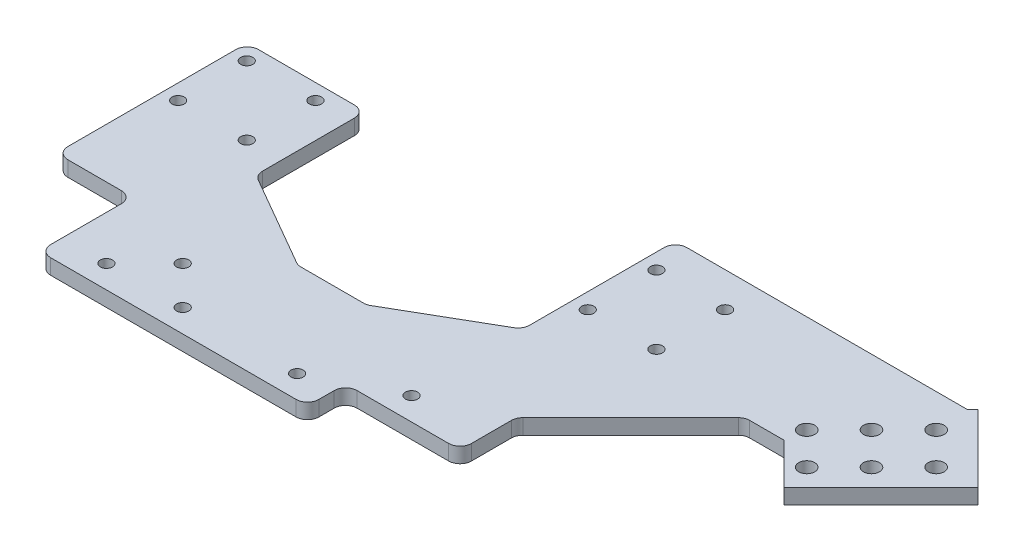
ISO-10303-21;
HEADER;
FILE_DESCRIPTION(('STEP AP214'),'2;1');
FILE_NAME('part.step','',(''),(''),'','','');
FILE_SCHEMA(('AUTOMOTIVE_DESIGN { 1 0 10303 214 1 1 1 1 }'));
ENDSEC;
DATA;
#1=APPLICATION_CONTEXT('core data for automotive mechanical design processes');
#2=APPLICATION_PROTOCOL_DEFINITION('international standard','automotive_design',2000,#1);
#3=PRODUCT_CONTEXT('',#1,'mechanical');
#4=PRODUCT('Part','Part','',(#3));
#5=PRODUCT_RELATED_PRODUCT_CATEGORY('part','',(#4));
#6=PRODUCT_DEFINITION_FORMATION('','',#4);
#7=PRODUCT_DEFINITION_CONTEXT('part definition',#1,'design');
#8=PRODUCT_DEFINITION('design','',#6,#7);
#9=PRODUCT_DEFINITION_SHAPE('','',#8);
#10=(LENGTH_UNIT() NAMED_UNIT(*) SI_UNIT(.MILLI.,.METRE.));
#11=(NAMED_UNIT(*) PLANE_ANGLE_UNIT() SI_UNIT($,.RADIAN.));
#12=(NAMED_UNIT(*) SI_UNIT($,.STERADIAN.) SOLID_ANGLE_UNIT());
#13=UNCERTAINTY_MEASURE_WITH_UNIT(LENGTH_MEASURE(1.E-05),#10,'distance_accuracy_value','');
#14=(GEOMETRIC_REPRESENTATION_CONTEXT(3) GLOBAL_UNCERTAINTY_ASSIGNED_CONTEXT((#13)) GLOBAL_UNIT_ASSIGNED_CONTEXT((#10,
#11,#12)) REPRESENTATION_CONTEXT('',''));
#15=CARTESIAN_POINT('',(0.,0.,0.));
#16=DIRECTION('',(0.,0.,1.));
#17=DIRECTION('',(1.,0.,0.));
#18=AXIS2_PLACEMENT_3D('',#15,#16,#17);
#19=CARTESIAN_POINT('',(0.,4.,0.));
#20=DIRECTION('',(0.,-1.,0.));
#21=DIRECTION('',(0.,0.,-1.));
#22=AXIS2_PLACEMENT_3D('',#19,#20,#21);
#23=PLANE('',#22);
#24=CARTESIAN_POINT('',(102.056502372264,4.,8.70698948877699));
#25=DIRECTION('',(0.,-1.,0.));
#26=DIRECTION('',(0.,0.,-1.));
#27=AXIS2_PLACEMENT_3D('',#24,#25,#26);
#28=CIRCLE('',#27,2.1);
#29=CARTESIAN_POINT('',(102.056502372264,4.,6.60698948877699));
#30=VERTEX_POINT('',#29);
#31=EDGE_CURVE('E769',#30,#30,#28,.T.);
#32=ORIENTED_EDGE('',*,*,#31,.T.);
#33=EDGE_LOOP('',(#32));
#34=FACE_BOUND('',#33,.T.);
#35=CARTESIAN_POINT('',(93.571220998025,4.,17.1922708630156));
#36=DIRECTION('',(0.,-1.,0.));
#37=DIRECTION('',(0.,0.,-1.));
#38=AXIS2_PLACEMENT_3D('',#35,#36,#37);
#39=CIRCLE('',#38,2.1);
#40=CARTESIAN_POINT('',(93.571220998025,4.,15.0922708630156));
#41=VERTEX_POINT('',#40);
#42=EDGE_CURVE('E775',#41,#41,#39,.T.);
#43=ORIENTED_EDGE('',*,*,#42,.T.);
#44=EDGE_LOOP('',(#43));
#45=FACE_BOUND('',#44,.T.);
#46=CARTESIAN_POINT('',(102.056502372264,4.,25.6775522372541));
#47=DIRECTION('',(0.,-1.,0.));
#48=DIRECTION('',(0.,0.,-1.));
#49=AXIS2_PLACEMENT_3D('',#46,#47,#48);
#50=CIRCLE('',#49,2.1);
#51=CARTESIAN_POINT('',(102.056502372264,4.,23.5775522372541));
#52=VERTEX_POINT('',#51);
#53=EDGE_CURVE('E758',#52,#52,#50,.T.);
#54=ORIENTED_EDGE('',*,*,#53,.T.);
#55=EDGE_LOOP('',(#54));
#56=FACE_BOUND('',#55,.T.);
#57=CARTESIAN_POINT('',(110.541783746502,4.,17.1922708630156));
#58=DIRECTION('',(0.,-1.,0.));
#59=DIRECTION('',(0.,0.,-1.));
#60=AXIS2_PLACEMENT_3D('',#57,#58,#59);
#61=CIRCLE('',#60,2.1);
#62=CARTESIAN_POINT('',(110.541783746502,4.,15.0922708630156));
#63=VERTEX_POINT('',#62);
#64=EDGE_CURVE('E757',#63,#63,#61,.T.);
#65=ORIENTED_EDGE('',*,*,#64,.T.);
#66=EDGE_LOOP('',(#65));
#67=FACE_BOUND('',#66,.T.);
#68=CARTESIAN_POINT('',(85.0859396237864,4.,25.6775522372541));
#69=DIRECTION('',(0.,-1.,0.));
#70=DIRECTION('',(0.,0.,-1.));
#71=AXIS2_PLACEMENT_3D('',#68,#69,#70);
#72=CIRCLE('',#71,2.1);
#73=CARTESIAN_POINT('',(85.0859396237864,4.,23.5775522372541));
#74=VERTEX_POINT('',#73);
#75=EDGE_CURVE('E751',#74,#74,#72,.T.);
#76=ORIENTED_EDGE('',*,*,#75,.T.);
#77=EDGE_LOOP('',(#76));
#78=FACE_BOUND('',#77,.T.);
#79=CARTESIAN_POINT('',(93.571220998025,4.,34.1628336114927));
#80=DIRECTION('',(0.,-1.,0.));
#81=DIRECTION('',(0.,0.,-1.));
#82=AXIS2_PLACEMENT_3D('',#79,#80,#81);
#83=CIRCLE('',#82,2.1);
#84=CARTESIAN_POINT('',(93.571220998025,4.,32.0628336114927));
#85=VERTEX_POINT('',#84);
#86=EDGE_CURVE('E293',#85,#85,#83,.T.);
#87=ORIENTED_EDGE('',*,*,#86,.T.);
#88=EDGE_LOOP('',(#87));
#89=FACE_BOUND('',#88,.T.);
#90=DIRECTION('',(1.,0.,0.));
#91=VECTOR('',#90,1.);
#92=CARTESIAN_POINT('',(74.22,4.,31.));
#93=LINE('',#92,#91);
#94=CARTESIAN_POINT('',(75.4626406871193,4.,31.));
#95=VERTEX_POINT('',#94);
#96=CARTESIAN_POINT('',(84.3979797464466,4.,31.));
#97=VERTEX_POINT('',#96);
#98=EDGE_CURVE('E400',#95,#97,#93,.T.);
#99=ORIENTED_EDGE('',*,*,#98,.T.);
#100=DIRECTION('',(-0.707106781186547,0.,-0.707106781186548));
#101=VECTOR('',#100,1.);
#102=CARTESIAN_POINT('',(95.1622112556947,4.,41.7642315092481));
#103=LINE('',#102,#101);
#104=CARTESIAN_POINT('',(95.1622112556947,4.,41.7642315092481));
#105=VERTEX_POINT('',#104);
#106=EDGE_CURVE('E271',#105,#97,#103,.T.);
#107=ORIENTED_EDGE('',*,*,#106,.F.);
#108=DIRECTION('',(-0.707106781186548,0.,0.707106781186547));
#109=VECTOR('',#108,1.);
#110=CARTESIAN_POINT('',(95.1622112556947,4.,41.7642315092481));
#111=LINE('',#110,#109);
#112=CARTESIAN_POINT('',(120.61805537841,4.,16.3083873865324));
#113=VERTEX_POINT('',#112);
#114=EDGE_CURVE('E280',#113,#105,#111,.T.);
#115=ORIENTED_EDGE('',*,*,#114,.F.);
#116=DIRECTION('',(0.707106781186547,0.,0.707106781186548));
#117=VECTOR('',#116,1.);
#118=CARTESIAN_POINT('',(120.61805537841,4.,16.3083873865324));
#119=LINE('',#118,#117);
#120=CARTESIAN_POINT('',(102.940385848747,4.,-1.36928214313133));
#121=VERTEX_POINT('',#120);
#122=EDGE_CURVE('E270',#121,#113,#119,.T.);
#123=ORIENTED_EDGE('',*,*,#122,.F.);
#124=DIRECTION('',(0.707106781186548,0.,-0.707106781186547));
#125=VECTOR('',#124,1.);
#126=CARTESIAN_POINT('',(77.484541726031,4.,24.0865619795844));
#127=LINE('',#126,#125);
#128=CARTESIAN_POINT('',(101.571103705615,4.,0.));
#129=VERTEX_POINT('',#128);
#130=EDGE_CURVE('E261',#129,#121,#127,.T.);
#131=ORIENTED_EDGE('',*,*,#130,.F.);
#132=DIRECTION('',(-1.,0.,0.));
#133=VECTOR('',#132,1.);
#134=CARTESIAN_POINT('',(103.92,4.,0.));
#135=LINE('',#134,#133);
#136=CARTESIAN_POINT('',(28.,4.,0.));
#137=VERTEX_POINT('',#136);
#138=EDGE_CURVE('E402',#129,#137,#135,.T.);
#139=ORIENTED_EDGE('',*,*,#138,.T.);
#140=CARTESIAN_POINT('',(28.,4.,3.00000000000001));
#141=DIRECTION('',(0.,-1.,0.));
#142=DIRECTION('',(0.,0.,-1.));
#143=AXIS2_PLACEMENT_3D('',#140,#141,#142);
#144=CIRCLE('',#143,3.);
#145=CARTESIAN_POINT('',(25.,4.,3.00000000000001));
#146=VERTEX_POINT('',#145);
#147=EDGE_CURVE('E476',#137,#146,#144,.F.);
#148=ORIENTED_EDGE('',*,*,#147,.T.);
#149=DIRECTION('',(0.,0.,1.));
#150=VECTOR('',#149,1.);
#151=CARTESIAN_POINT('',(25.,4.,0.));
#152=LINE('',#151,#150);
#153=CARTESIAN_POINT('',(25.,4.,38.2679491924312));
#154=VERTEX_POINT('',#153);
#155=EDGE_CURVE('E404',#146,#154,#152,.T.);
#156=ORIENTED_EDGE('',*,*,#155,.T.);
#157=CARTESIAN_POINT('',(22.,4.,38.2679491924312));
#158=DIRECTION('',(0.,-1.,0.));
#159=DIRECTION('',(0.,0.,-1.));
#160=AXIS2_PLACEMENT_3D('',#157,#158,#159);
#161=CIRCLE('',#160,3.);
#162=CARTESIAN_POINT('',(23.5,4.,40.8660254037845));
#163=VERTEX_POINT('',#162);
#164=EDGE_CURVE('E603',#154,#163,#161,.T.);
#165=ORIENTED_EDGE('',*,*,#164,.T.);
#166=DIRECTION('',(0.866025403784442,0.,-0.499999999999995));
#167=VECTOR('',#166,1.);
#168=CARTESIAN_POINT('',(23.5705080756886,4.,40.8253175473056));
#169=LINE('',#168,#167);
#170=CARTESIAN_POINT('',(-0.284609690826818,4.,54.5980762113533));
#171=VERTEX_POINT('',#170);
#172=EDGE_CURVE('E468',#163,#171,#169,.F.);
#173=ORIENTED_EDGE('',*,*,#172,.T.);
#174=CARTESIAN_POINT('',(-1.78460969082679,4.,52.));
#175=DIRECTION('',(0.,-1.,0.));
#176=DIRECTION('',(0.,0.,-1.));
#177=AXIS2_PLACEMENT_3D('',#174,#175,#176);
#178=CIRCLE('',#177,3.);
#179=CARTESIAN_POINT('',(-1.78460969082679,4.,55.));
#180=VERTEX_POINT('',#179);
#181=EDGE_CURVE('E601',#171,#180,#178,.T.);
#182=ORIENTED_EDGE('',*,*,#181,.T.);
#183=DIRECTION('',(-1.,0.,0.));
#184=VECTOR('',#183,1.);
#185=CARTESIAN_POINT('',(25.,4.,55.));
#186=LINE('',#185,#184);
#187=CARTESIAN_POINT('',(-18.2153903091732,4.,55.));
#188=VERTEX_POINT('',#187);
#189=EDGE_CURVE('E407',#180,#188,#186,.T.);
#190=ORIENTED_EDGE('',*,*,#189,.T.);
#191=CARTESIAN_POINT('',(-18.2153903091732,4.,52.));
#192=DIRECTION('',(0.,-1.,0.));
#193=DIRECTION('',(0.,0.,-1.));
#194=AXIS2_PLACEMENT_3D('',#191,#192,#193);
#195=CIRCLE('',#194,3.);
#196=CARTESIAN_POINT('',(-19.7153903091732,4.,54.5980762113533));
#197=VERTEX_POINT('',#196);
#198=EDGE_CURVE('E595',#188,#197,#195,.T.);
#199=ORIENTED_EDGE('',*,*,#198,.T.);
#200=DIRECTION('',(0.866025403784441,0.,0.499999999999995));
#201=VECTOR('',#200,1.);
#202=CARTESIAN_POINT('',(-28.5705080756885,4.,49.48557158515));
#203=LINE('',#202,#201);
#204=CARTESIAN_POINT('',(-43.5,4.,40.8660254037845));
#205=VERTEX_POINT('',#204);
#206=EDGE_CURVE('E462',#197,#205,#203,.F.);
#207=ORIENTED_EDGE('',*,*,#206,.T.);
#208=CARTESIAN_POINT('',(-42.,4.,38.2679491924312));
#209=DIRECTION('',(0.,-1.,0.));
#210=DIRECTION('',(0.,0.,-1.));
#211=AXIS2_PLACEMENT_3D('',#208,#209,#210);
#212=CIRCLE('',#211,3.);
#213=CARTESIAN_POINT('',(-45.,4.,38.2679491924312));
#214=VERTEX_POINT('',#213);
#215=EDGE_CURVE('E593',#205,#214,#212,.T.);
#216=ORIENTED_EDGE('',*,*,#215,.T.);
#217=DIRECTION('',(0.,0.,-1.));
#218=VECTOR('',#217,1.);
#219=CARTESIAN_POINT('',(-45.,4.,55.));
#220=LINE('',#219,#218);
#221=CARTESIAN_POINT('',(-45.,4.,14.2));
#222=VERTEX_POINT('',#221);
#223=EDGE_CURVE('E410',#214,#222,#220,.T.);
#224=ORIENTED_EDGE('',*,*,#223,.T.);
#225=CARTESIAN_POINT('',(-48.,4.,14.2));
#226=DIRECTION('',(0.,-1.,0.));
#227=DIRECTION('',(0.,0.,-1.));
#228=AXIS2_PLACEMENT_3D('',#225,#226,#227);
#229=CIRCLE('',#228,3.);
#230=CARTESIAN_POINT('',(-48.,4.,11.2));
#231=VERTEX_POINT('',#230);
#232=EDGE_CURVE('E478',#222,#231,#229,.F.);
#233=ORIENTED_EDGE('',*,*,#232,.T.);
#234=DIRECTION('',(-1.,0.,0.));
#235=VECTOR('',#234,1.);
#236=CARTESIAN_POINT('',(-45.,4.,11.2));
#237=LINE('',#236,#235);
#238=CARTESIAN_POINT('',(-73.1,4.,11.2));
#239=VERTEX_POINT('',#238);
#240=EDGE_CURVE('E413',#231,#239,#237,.T.);
#241=ORIENTED_EDGE('',*,*,#240,.T.);
#242=CARTESIAN_POINT('',(-73.1,4.,14.2));
#243=DIRECTION('',(0.,-1.,0.));
#244=DIRECTION('',(0.,0.,-1.));
#245=AXIS2_PLACEMENT_3D('',#242,#243,#244);
#246=CIRCLE('',#245,3.);
#247=CARTESIAN_POINT('',(-76.1,4.,14.2));
#248=VERTEX_POINT('',#247);
#249=EDGE_CURVE('E480',#239,#248,#246,.F.);
#250=ORIENTED_EDGE('',*,*,#249,.T.);
#251=DIRECTION('',(0.,0.,1.));
#252=VECTOR('',#251,1.);
#253=CARTESIAN_POINT('',(-76.1,4.,11.2));
#254=LINE('',#253,#252);
#255=CARTESIAN_POINT('',(-76.1,4.,58.2));
#256=VERTEX_POINT('',#255);
#257=EDGE_CURVE('E416',#248,#256,#254,.T.);
#258=ORIENTED_EDGE('',*,*,#257,.T.);
#259=CARTESIAN_POINT('',(-73.1,4.,58.2));
#260=DIRECTION('',(0.,-1.,0.));
#261=DIRECTION('',(0.,0.,-1.));
#262=AXIS2_PLACEMENT_3D('',#259,#260,#261);
#263=CIRCLE('',#262,3.);
#264=CARTESIAN_POINT('',(-73.1,4.,61.2));
#265=VERTEX_POINT('',#264);
#266=EDGE_CURVE('E482',#256,#265,#263,.F.);
#267=ORIENTED_EDGE('',*,*,#266,.T.);
#268=DIRECTION('',(1.,0.,0.));
#269=VECTOR('',#268,1.);
#270=CARTESIAN_POINT('',(-76.1,4.,61.2));
#271=LINE('',#270,#269);
#272=CARTESIAN_POINT('',(-59.1,4.,61.2));
#273=VERTEX_POINT('',#272);
#274=EDGE_CURVE('E419',#265,#273,#271,.T.);
#275=ORIENTED_EDGE('',*,*,#274,.T.);
#276=CARTESIAN_POINT('',(-59.1,4.,64.2));
#277=DIRECTION('',(0.,-1.,0.));
#278=DIRECTION('',(0.,0.,-1.));
#279=AXIS2_PLACEMENT_3D('',#276,#277,#278);
#280=CIRCLE('',#279,3.);
#281=CARTESIAN_POINT('',(-56.1,4.,64.2));
#282=VERTEX_POINT('',#281);
#283=EDGE_CURVE('E589',#273,#282,#280,.T.);
#284=ORIENTED_EDGE('',*,*,#283,.T.);
#285=DIRECTION('',(0.,0.,1.));
#286=VECTOR('',#285,1.);
#287=CARTESIAN_POINT('',(-56.1,4.,61.2));
#288=LINE('',#287,#286);
#289=CARTESIAN_POINT('',(-56.1,4.,82.7));
#290=VERTEX_POINT('',#289);
#291=EDGE_CURVE('E422',#282,#290,#288,.T.);
#292=ORIENTED_EDGE('',*,*,#291,.T.);
#293=CARTESIAN_POINT('',(-53.1,4.,82.7));
#294=DIRECTION('',(0.,-1.,0.));
#295=DIRECTION('',(0.,0.,-1.));
#296=AXIS2_PLACEMENT_3D('',#293,#294,#295);
#297=CIRCLE('',#296,3.);
#298=CARTESIAN_POINT('',(-53.1,4.,85.7));
#299=VERTEX_POINT('',#298);
#300=EDGE_CURVE('E484',#290,#299,#297,.F.);
#301=ORIENTED_EDGE('',*,*,#300,.T.);
#302=DIRECTION('',(1.,0.,0.));
#303=VECTOR('',#302,1.);
#304=CARTESIAN_POINT('',(-56.1,4.,85.7));
#305=LINE('',#304,#303);
#306=CARTESIAN_POINT('',(11.22,4.,85.7));
#307=VERTEX_POINT('',#306);
#308=EDGE_CURVE('E425',#299,#307,#305,.T.);
#309=ORIENTED_EDGE('',*,*,#308,.T.);
#310=CARTESIAN_POINT('',(11.22,4.,82.7));
#311=DIRECTION('',(0.,-1.,0.));
#312=DIRECTION('',(0.,0.,-1.));
#313=AXIS2_PLACEMENT_3D('',#310,#311,#312);
#314=CIRCLE('',#313,3.);
#315=CARTESIAN_POINT('',(14.22,4.,82.7));
#316=VERTEX_POINT('',#315);
#317=EDGE_CURVE('E486',#307,#316,#314,.F.);
#318=ORIENTED_EDGE('',*,*,#317,.T.);
#319=DIRECTION('',(0.,0.,1.));
#320=VECTOR('',#319,1.);
#321=CARTESIAN_POINT('',(14.22,4.,85.7));
#322=LINE('',#321,#320);
#323=CARTESIAN_POINT('',(14.22,4.,78.7));
#324=VERTEX_POINT('',#323);
#325=EDGE_CURVE('E308',#324,#316,#322,.T.);
#326=ORIENTED_EDGE('',*,*,#325,.F.);
#327=CARTESIAN_POINT('',(17.22,4.,78.7));
#328=DIRECTION('',(0.,-1.,0.));
#329=DIRECTION('',(0.,0.,-1.));
#330=AXIS2_PLACEMENT_3D('',#327,#328,#329);
#331=CIRCLE('',#330,3.);
#332=CARTESIAN_POINT('',(17.22,4.,75.7));
#333=VERTEX_POINT('',#332);
#334=EDGE_CURVE('E575',#324,#333,#331,.T.);
#335=ORIENTED_EDGE('',*,*,#334,.T.);
#336=DIRECTION('',(-1.,0.,0.));
#337=VECTOR('',#336,1.);
#338=CARTESIAN_POINT('',(44.22,4.,75.7));
#339=LINE('',#338,#337);
#340=CARTESIAN_POINT('',(41.22,4.,75.7));
#341=VERTEX_POINT('',#340);
#342=EDGE_CURVE('E305',#341,#333,#339,.T.);
#343=ORIENTED_EDGE('',*,*,#342,.F.);
#344=CARTESIAN_POINT('',(41.22,4.,72.7));
#345=DIRECTION('',(0.,-1.,0.));
#346=DIRECTION('',(0.,0.,-1.));
#347=AXIS2_PLACEMENT_3D('',#344,#345,#346);
#348=CIRCLE('',#347,3.);
#349=CARTESIAN_POINT('',(44.22,4.,72.7));
#350=VERTEX_POINT('',#349);
#351=EDGE_CURVE('E488',#341,#350,#348,.F.);
#352=ORIENTED_EDGE('',*,*,#351,.T.);
#353=DIRECTION('',(0.,0.,-1.));
#354=VECTOR('',#353,1.);
#355=CARTESIAN_POINT('',(44.22,4.,85.7));
#356=LINE('',#355,#354);
#357=CARTESIAN_POINT('',(44.22,4.,62.2426406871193));
#358=VERTEX_POINT('',#357);
#359=EDGE_CURVE('E393',#350,#358,#356,.T.);
#360=ORIENTED_EDGE('',*,*,#359,.T.);
#361=CARTESIAN_POINT('',(47.22,4.,62.2426406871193));
#362=DIRECTION('',(0.,-1.,0.));
#363=DIRECTION('',(0.,0.,-1.));
#364=AXIS2_PLACEMENT_3D('',#361,#362,#363);
#365=CIRCLE('',#364,3.);
#366=CARTESIAN_POINT('',(45.0986796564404,4.,60.1213203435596));
#367=VERTEX_POINT('',#366);
#368=EDGE_CURVE('E585',#358,#367,#365,.T.);
#369=ORIENTED_EDGE('',*,*,#368,.T.);
#370=DIRECTION('',(0.707106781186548,0.,-0.707106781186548));
#371=VECTOR('',#370,1.);
#372=CARTESIAN_POINT('',(44.22,4.,61.));
#373=LINE('',#372,#371);
#374=CARTESIAN_POINT('',(73.3413203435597,4.,31.8786796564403));
#375=VERTEX_POINT('',#374);
#376=EDGE_CURVE('E396',#367,#375,#373,.T.);
#377=ORIENTED_EDGE('',*,*,#376,.T.);
#378=CARTESIAN_POINT('',(75.4626406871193,4.,34.));
#379=DIRECTION('',(0.,-1.,0.));
#380=DIRECTION('',(0.,0.,-1.));
#381=AXIS2_PLACEMENT_3D('',#378,#379,#380);
#382=CIRCLE('',#381,3.);
#383=EDGE_CURVE('E581',#375,#95,#382,.T.);
#384=ORIENTED_EDGE('',*,*,#383,.T.);
#385=EDGE_LOOP('',(#99,#107,#115,#123,#131,#139,#148,#156,#165,#173,#182,#190,#199,#207,#216,
#224,#233,#241,#250,#258,#267,#275,#284,#292,#301,#309,#318,#326,#335,#343,#352,#360,#369,#377,#384));
#386=FACE_BOUND('',#385,.T.);
#387=CARTESIAN_POINT('',(5.5,4.,79.7));
#388=DIRECTION('',(0.,1.,0.));
#389=DIRECTION('',(0.,0.,1.));
#390=AXIS2_PLACEMENT_3D('',#387,#388,#389);
#391=CIRCLE('',#390,1.60000000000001);
#392=CARTESIAN_POINT('',(5.5,4.,81.3));
#393=VERTEX_POINT('',#392);
#394=EDGE_CURVE('E387',#393,#393,#391,.T.);
#395=ORIENTED_EDGE('',*,*,#394,.F.);
#396=EDGE_LOOP('',(#395));
#397=FACE_BOUND('',#396,.T.);
#398=CARTESIAN_POINT('',(25.5,4.,69.7));
#399=DIRECTION('',(0.,1.,0.));
#400=DIRECTION('',(0.,0.,1.));
#401=AXIS2_PLACEMENT_3D('',#398,#399,#400);
#402=CIRCLE('',#401,1.60000000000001);
#403=CARTESIAN_POINT('',(25.5,4.,71.3));
#404=VERTEX_POINT('',#403);
#405=EDGE_CURVE('E381',#404,#404,#402,.T.);
#406=ORIENTED_EDGE('',*,*,#405,.F.);
#407=EDGE_LOOP('',(#406));
#408=FACE_BOUND('',#407,.T.);
#409=CARTESIAN_POINT('',(-72.1,4.,15.3));
#410=DIRECTION('',(0.,1.,0.));
#411=DIRECTION('',(0.,0.,1.));
#412=AXIS2_PLACEMENT_3D('',#409,#410,#411);
#413=CIRCLE('',#412,1.6);
#414=CARTESIAN_POINT('',(-72.1,4.,16.9));
#415=VERTEX_POINT('',#414);
#416=EDGE_CURVE('E375',#415,#415,#413,.T.);
#417=ORIENTED_EDGE('',*,*,#416,.F.);
#418=EDGE_LOOP('',(#417));
#419=FACE_BOUND('',#418,.T.);
#420=CARTESIAN_POINT('',(-54.1,4.,15.3));
#421=DIRECTION('',(0.,1.,0.));
#422=DIRECTION('',(0.,0.,1.));
#423=AXIS2_PLACEMENT_3D('',#420,#421,#422);
#424=CIRCLE('',#423,1.6);
#425=CARTESIAN_POINT('',(-54.1,4.,16.9));
#426=VERTEX_POINT('',#425);
#427=EDGE_CURVE('E369',#426,#426,#424,.T.);
#428=ORIENTED_EDGE('',*,*,#427,.F.);
#429=EDGE_LOOP('',(#428));
#430=FACE_BOUND('',#429,.T.);
#431=CARTESIAN_POINT('',(-54.1,4.,33.3));
#432=DIRECTION('',(0.,1.,0.));
#433=DIRECTION('',(0.,0.,1.));
#434=AXIS2_PLACEMENT_3D('',#431,#432,#433);
#435=CIRCLE('',#434,1.59999999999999);
#436=CARTESIAN_POINT('',(-54.1,4.,34.9));
#437=VERTEX_POINT('',#436);
#438=EDGE_CURVE('E363',#437,#437,#435,.T.);
#439=ORIENTED_EDGE('',*,*,#438,.F.);
#440=EDGE_LOOP('',(#439));
#441=FACE_BOUND('',#440,.T.);
#442=CARTESIAN_POINT('',(-72.1,4.,33.3));
#443=DIRECTION('',(0.,1.,0.));
#444=DIRECTION('',(0.,0.,1.));
#445=AXIS2_PLACEMENT_3D('',#442,#443,#444);
#446=CIRCLE('',#445,1.60000000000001);
#447=CARTESIAN_POINT('',(-72.1,4.,34.9));
#448=VERTEX_POINT('',#447);
#449=EDGE_CURVE('E357',#448,#448,#446,.T.);
#450=ORIENTED_EDGE('',*,*,#449,.F.);
#451=EDGE_LOOP('',(#450));
#452=FACE_BOUND('',#451,.T.);
#453=CARTESIAN_POINT('',(47.1,4.,27.1));
#454=DIRECTION('',(0.,1.,0.));
#455=DIRECTION('',(0.,0.,1.));
#456=AXIS2_PLACEMENT_3D('',#453,#454,#455);
#457=CIRCLE('',#456,1.6);
#458=CARTESIAN_POINT('',(47.1,4.,28.7));
#459=VERTEX_POINT('',#458);
#460=EDGE_CURVE('E351',#459,#459,#457,.T.);
#461=ORIENTED_EDGE('',*,*,#460,.F.);
#462=EDGE_LOOP('',(#461));
#463=FACE_BOUND('',#462,.T.);
#464=CARTESIAN_POINT('',(47.1,4.,9.10000000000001));
#465=DIRECTION('',(0.,1.,0.));
#466=DIRECTION('',(0.,0.,1.));
#467=AXIS2_PLACEMENT_3D('',#464,#465,#466);
#468=CIRCLE('',#467,1.6);
#469=CARTESIAN_POINT('',(47.1,4.,10.7));
#470=VERTEX_POINT('',#469);
#471=EDGE_CURVE('E345',#470,#470,#468,.T.);
#472=ORIENTED_EDGE('',*,*,#471,.F.);
#473=EDGE_LOOP('',(#472));
#474=FACE_BOUND('',#473,.T.);
#475=CARTESIAN_POINT('',(29.1,4.,9.10000000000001));
#476=DIRECTION('',(0.,1.,0.));
#477=DIRECTION('',(0.,0.,1.));
#478=AXIS2_PLACEMENT_3D('',#475,#476,#477);
#479=CIRCLE('',#478,1.6);
#480=CARTESIAN_POINT('',(29.1,4.,10.7));
#481=VERTEX_POINT('',#480);
#482=EDGE_CURVE('E339',#481,#481,#479,.T.);
#483=ORIENTED_EDGE('',*,*,#482,.F.);
#484=EDGE_LOOP('',(#483));
#485=FACE_BOUND('',#484,.T.);
#486=CARTESIAN_POINT('',(29.1,4.,27.1));
#487=DIRECTION('',(0.,1.,0.));
#488=DIRECTION('',(0.,0.,1.));
#489=AXIS2_PLACEMENT_3D('',#486,#487,#488);
#490=CIRCLE('',#489,1.6);
#491=CARTESIAN_POINT('',(29.1,4.,28.7));
#492=VERTEX_POINT('',#491);
#493=EDGE_CURVE('E333',#492,#492,#490,.T.);
#494=ORIENTED_EDGE('',*,*,#493,.F.);
#495=EDGE_LOOP('',(#494));
#496=FACE_BOUND('',#495,.T.);
#497=CARTESIAN_POINT('',(-24.5,4.,79.7));
#498=DIRECTION('',(0.,1.,0.));
#499=DIRECTION('',(0.,0.,1.));
#500=AXIS2_PLACEMENT_3D('',#497,#498,#499);
#501=CIRCLE('',#500,1.60000000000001);
#502=CARTESIAN_POINT('',(-24.5,4.,81.3));
#503=VERTEX_POINT('',#502);
#504=EDGE_CURVE('E327',#503,#503,#501,.T.);
#505=ORIENTED_EDGE('',*,*,#504,.F.);
#506=EDGE_LOOP('',(#505));
#507=FACE_BOUND('',#506,.T.);
#508=CARTESIAN_POINT('',(-44.5,4.,79.7));
#509=DIRECTION('',(0.,1.,0.));
#510=DIRECTION('',(0.,0.,1.));
#511=AXIS2_PLACEMENT_3D('',#508,#509,#510);
#512=CIRCLE('',#511,1.59999999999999);
#513=CARTESIAN_POINT('',(-44.5,4.,81.3));
#514=VERTEX_POINT('',#513);
#515=EDGE_CURVE('E321',#514,#514,#512,.T.);
#516=ORIENTED_EDGE('',*,*,#515,.F.);
#517=EDGE_LOOP('',(#516));
#518=FACE_BOUND('',#517,.T.);
#519=CARTESIAN_POINT('',(-34.5,4.,69.7));
#520=DIRECTION('',(0.,1.,0.));
#521=DIRECTION('',(0.,0.,1.));
#522=AXIS2_PLACEMENT_3D('',#519,#520,#521);
#523=CIRCLE('',#522,1.60000000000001);
#524=CARTESIAN_POINT('',(-34.5,4.,71.3));
#525=VERTEX_POINT('',#524);
#526=EDGE_CURVE('E315',#525,#525,#523,.T.);
#527=ORIENTED_EDGE('',*,*,#526,.F.);
#528=EDGE_LOOP('',(#527));
#529=FACE_BOUND('',#528,.T.);
#530=ADVANCED_FACE('F35',(#34,#45,#56,#67,#78,#89,#386,#397,#408,#419,#430,#441,#452,#463,#474,
#485,#496,#507,#518,#529),#23,.F.);
#531=CARTESIAN_POINT('',(0.,0.,0.));
#532=DIRECTION('',(0.,-1.,0.));
#533=DIRECTION('',(0.,0.,-1.));
#534=AXIS2_PLACEMENT_3D('',#531,#532,#533);
#535=PLANE('',#534);
#536=CARTESIAN_POINT('',(102.056502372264,0.,8.70698948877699));
#537=DIRECTION('',(0.,-1.,0.));
#538=DIRECTION('',(0.,0.,-1.));
#539=AXIS2_PLACEMENT_3D('',#536,#537,#538);
#540=CIRCLE('',#539,2.1);
#541=CARTESIAN_POINT('',(102.056502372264,0.,6.60698948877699));
#542=VERTEX_POINT('',#541);
#543=EDGE_CURVE('E766',#542,#542,#540,.T.);
#544=ORIENTED_EDGE('',*,*,#543,.F.);
#545=EDGE_LOOP('',(#544));
#546=FACE_BOUND('',#545,.T.);
#547=CARTESIAN_POINT('',(93.571220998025,0.,17.1922708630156));
#548=DIRECTION('',(0.,-1.,0.));
#549=DIRECTION('',(0.,0.,-1.));
#550=AXIS2_PLACEMENT_3D('',#547,#548,#549);
#551=CIRCLE('',#550,2.1);
#552=CARTESIAN_POINT('',(93.571220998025,0.,15.0922708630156));
#553=VERTEX_POINT('',#552);
#554=EDGE_CURVE('E772',#553,#553,#551,.T.);
#555=ORIENTED_EDGE('',*,*,#554,.F.);
#556=EDGE_LOOP('',(#555));
#557=FACE_BOUND('',#556,.T.);
#558=CARTESIAN_POINT('',(102.056502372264,0.,25.6775522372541));
#559=DIRECTION('',(0.,-1.,0.));
#560=DIRECTION('',(0.,0.,-1.));
#561=AXIS2_PLACEMENT_3D('',#558,#559,#560);
#562=CIRCLE('',#561,2.1);
#563=CARTESIAN_POINT('',(102.056502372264,0.,23.5775522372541));
#564=VERTEX_POINT('',#563);
#565=EDGE_CURVE('E778',#564,#564,#562,.T.);
#566=ORIENTED_EDGE('',*,*,#565,.F.);
#567=EDGE_LOOP('',(#566));
#568=FACE_BOUND('',#567,.T.);
#569=CARTESIAN_POINT('',(110.541783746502,0.,17.1922708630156));
#570=DIRECTION('',(0.,-1.,0.));
#571=DIRECTION('',(0.,0.,-1.));
#572=AXIS2_PLACEMENT_3D('',#569,#570,#571);
#573=CIRCLE('',#572,2.1);
#574=CARTESIAN_POINT('',(110.541783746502,0.,15.0922708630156));
#575=VERTEX_POINT('',#574);
#576=EDGE_CURVE('E754',#575,#575,#573,.T.);
#577=ORIENTED_EDGE('',*,*,#576,.F.);
#578=EDGE_LOOP('',(#577));
#579=FACE_BOUND('',#578,.T.);
#580=CARTESIAN_POINT('',(85.0859396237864,0.,25.6775522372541));
#581=DIRECTION('',(0.,-1.,0.));
#582=DIRECTION('',(0.,0.,-1.));
#583=AXIS2_PLACEMENT_3D('',#580,#581,#582);
#584=CIRCLE('',#583,2.1);
#585=CARTESIAN_POINT('',(85.0859396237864,0.,23.5775522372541));
#586=VERTEX_POINT('',#585);
#587=EDGE_CURVE('E761',#586,#586,#584,.T.);
#588=ORIENTED_EDGE('',*,*,#587,.F.);
#589=EDGE_LOOP('',(#588));
#590=FACE_BOUND('',#589,.T.);
#591=CARTESIAN_POINT('',(93.571220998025,0.,34.1628336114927));
#592=DIRECTION('',(0.,-1.,0.));
#593=DIRECTION('',(0.,0.,-1.));
#594=AXIS2_PLACEMENT_3D('',#591,#592,#593);
#595=CIRCLE('',#594,2.1);
#596=CARTESIAN_POINT('',(93.571220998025,0.,32.0628336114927));
#597=VERTEX_POINT('',#596);
#598=EDGE_CURVE('E748',#597,#597,#595,.T.);
#599=ORIENTED_EDGE('',*,*,#598,.F.);
#600=EDGE_LOOP('',(#599));
#601=FACE_BOUND('',#600,.T.);
#602=DIRECTION('',(-0.707106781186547,0.,-0.707106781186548));
#603=VECTOR('',#602,1.);
#604=CARTESIAN_POINT('',(95.1622112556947,0.,41.7642315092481));
#605=LINE('',#604,#603);
#606=CARTESIAN_POINT('',(95.1622112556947,0.,41.7642315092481));
#607=VERTEX_POINT('',#606);
#608=CARTESIAN_POINT('',(84.3979797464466,0.,31.));
#609=VERTEX_POINT('',#608);
#610=EDGE_CURVE('E289',#607,#609,#605,.T.);
#611=ORIENTED_EDGE('',*,*,#610,.T.);
#612=DIRECTION('',(1.,0.,0.));
#613=VECTOR('',#612,1.);
#614=CARTESIAN_POINT('',(74.22,0.,31.));
#615=LINE('',#614,#613);
#616=CARTESIAN_POINT('',(75.4626406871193,0.,31.));
#617=VERTEX_POINT('',#616);
#618=EDGE_CURVE('E49',#617,#609,#615,.T.);
#619=ORIENTED_EDGE('',*,*,#618,.F.);
#620=CARTESIAN_POINT('',(75.4626406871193,0.,34.));
#621=DIRECTION('',(0.,-1.,0.));
#622=DIRECTION('',(0.,0.,-1.));
#623=AXIS2_PLACEMENT_3D('',#620,#621,#622);
#624=CIRCLE('',#623,3.);
#625=CARTESIAN_POINT('',(73.3413203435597,0.,31.8786796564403));
#626=VERTEX_POINT('',#625);
#627=EDGE_CURVE('E579',#617,#626,#624,.F.);
#628=ORIENTED_EDGE('',*,*,#627,.T.);
#629=DIRECTION('',(0.707106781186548,0.,-0.707106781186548));
#630=VECTOR('',#629,1.);
#631=CARTESIAN_POINT('',(44.22,0.,61.));
#632=LINE('',#631,#630);
#633=CARTESIAN_POINT('',(45.0986796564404,0.,60.1213203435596));
#634=VERTEX_POINT('',#633);
#635=EDGE_CURVE('E431',#634,#626,#632,.T.);
#636=ORIENTED_EDGE('',*,*,#635,.F.);
#637=CARTESIAN_POINT('',(47.22,0.,62.2426406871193));
#638=DIRECTION('',(0.,-1.,0.));
#639=DIRECTION('',(0.,0.,-1.));
#640=AXIS2_PLACEMENT_3D('',#637,#638,#639);
#641=CIRCLE('',#640,3.);
#642=CARTESIAN_POINT('',(44.22,0.,62.2426406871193));
#643=VERTEX_POINT('',#642);
#644=EDGE_CURVE('E583',#634,#643,#641,.F.);
#645=ORIENTED_EDGE('',*,*,#644,.T.);
#646=DIRECTION('',(0.,0.,-1.));
#647=VECTOR('',#646,1.);
#648=CARTESIAN_POINT('',(44.22,0.,85.7));
#649=LINE('',#648,#647);
#650=CARTESIAN_POINT('',(44.22,0.,72.7));
#651=VERTEX_POINT('',#650);
#652=EDGE_CURVE('E390',#651,#643,#649,.T.);
#653=ORIENTED_EDGE('',*,*,#652,.F.);
#654=CARTESIAN_POINT('',(41.22,0.,72.7));
#655=DIRECTION('',(0.,-1.,0.));
#656=DIRECTION('',(0.,0.,-1.));
#657=AXIS2_PLACEMENT_3D('',#654,#655,#656);
#658=CIRCLE('',#657,3.);
#659=CARTESIAN_POINT('',(41.22,0.,75.7));
#660=VERTEX_POINT('',#659);
#661=EDGE_CURVE('E507',#651,#660,#658,.T.);
#662=ORIENTED_EDGE('',*,*,#661,.T.);
#663=DIRECTION('',(-1.,0.,0.));
#664=VECTOR('',#663,1.);
#665=CARTESIAN_POINT('',(44.22,0.,75.7));
#666=LINE('',#665,#664);
#667=CARTESIAN_POINT('',(17.22,0.,75.7));
#668=VERTEX_POINT('',#667);
#669=EDGE_CURVE('E311',#660,#668,#666,.T.);
#670=ORIENTED_EDGE('',*,*,#669,.T.);
#671=CARTESIAN_POINT('',(17.22,0.,78.7));
#672=DIRECTION('',(0.,-1.,0.));
#673=DIRECTION('',(0.,0.,-1.));
#674=AXIS2_PLACEMENT_3D('',#671,#672,#673);
#675=CIRCLE('',#674,3.);
#676=CARTESIAN_POINT('',(14.22,0.,78.7));
#677=VERTEX_POINT('',#676);
#678=EDGE_CURVE('E577',#668,#677,#675,.F.);
#679=ORIENTED_EDGE('',*,*,#678,.T.);
#680=DIRECTION('',(0.,0.,1.));
#681=VECTOR('',#680,1.);
#682=CARTESIAN_POINT('',(14.22,0.,85.7));
#683=LINE('',#682,#681);
#684=CARTESIAN_POINT('',(14.22,0.,82.7));
#685=VERTEX_POINT('',#684);
#686=EDGE_CURVE('E301',#677,#685,#683,.T.);
#687=ORIENTED_EDGE('',*,*,#686,.T.);
#688=CARTESIAN_POINT('',(11.22,0.,82.7));
#689=DIRECTION('',(0.,-1.,0.));
#690=DIRECTION('',(0.,0.,-1.));
#691=AXIS2_PLACEMENT_3D('',#688,#689,#690);
#692=CIRCLE('',#691,3.);
#693=CARTESIAN_POINT('',(11.22,0.,85.7));
#694=VERTEX_POINT('',#693);
#695=EDGE_CURVE('E505',#685,#694,#692,.T.);
#696=ORIENTED_EDGE('',*,*,#695,.T.);
#697=DIRECTION('',(1.,0.,0.));
#698=VECTOR('',#697,1.);
#699=CARTESIAN_POINT('',(-56.1,0.,85.7));
#700=LINE('',#699,#698);
#701=CARTESIAN_POINT('',(-53.1,0.,85.7));
#702=VERTEX_POINT('',#701);
#703=EDGE_CURVE('E397',#702,#694,#700,.T.);
#704=ORIENTED_EDGE('',*,*,#703,.F.);
#705=CARTESIAN_POINT('',(-53.1,0.,82.7));
#706=DIRECTION('',(0.,-1.,0.));
#707=DIRECTION('',(0.,0.,-1.));
#708=AXIS2_PLACEMENT_3D('',#705,#706,#707);
#709=CIRCLE('',#708,3.);
#710=CARTESIAN_POINT('',(-56.1,0.,82.7));
#711=VERTEX_POINT('',#710);
#712=EDGE_CURVE('E503',#702,#711,#709,.T.);
#713=ORIENTED_EDGE('',*,*,#712,.T.);
#714=DIRECTION('',(0.,0.,1.));
#715=VECTOR('',#714,1.);
#716=CARTESIAN_POINT('',(-56.1,0.,61.2));
#717=LINE('',#716,#715);
#718=CARTESIAN_POINT('',(-56.1,0.,64.2));
#719=VERTEX_POINT('',#718);
#720=EDGE_CURVE('E455',#719,#711,#717,.T.);
#721=ORIENTED_EDGE('',*,*,#720,.F.);
#722=CARTESIAN_POINT('',(-59.1,0.,64.2));
#723=DIRECTION('',(0.,-1.,0.));
#724=DIRECTION('',(0.,0.,-1.));
#725=AXIS2_PLACEMENT_3D('',#722,#723,#724);
#726=CIRCLE('',#725,3.);
#727=CARTESIAN_POINT('',(-59.1,0.,61.2));
#728=VERTEX_POINT('',#727);
#729=EDGE_CURVE('E587',#719,#728,#726,.F.);
#730=ORIENTED_EDGE('',*,*,#729,.T.);
#731=DIRECTION('',(1.,0.,0.));
#732=VECTOR('',#731,1.);
#733=CARTESIAN_POINT('',(-76.1,0.,61.2));
#734=LINE('',#733,#732);
#735=CARTESIAN_POINT('',(-73.1,0.,61.2));
#736=VERTEX_POINT('',#735);
#737=EDGE_CURVE('E452',#736,#728,#734,.T.);
#738=ORIENTED_EDGE('',*,*,#737,.F.);
#739=CARTESIAN_POINT('',(-73.1,0.,58.2));
#740=DIRECTION('',(0.,-1.,0.));
#741=DIRECTION('',(0.,0.,-1.));
#742=AXIS2_PLACEMENT_3D('',#739,#740,#741);
#743=CIRCLE('',#742,3.);
#744=CARTESIAN_POINT('',(-76.1,0.,58.2));
#745=VERTEX_POINT('',#744);
#746=EDGE_CURVE('E501',#736,#745,#743,.T.);
#747=ORIENTED_EDGE('',*,*,#746,.T.);
#748=DIRECTION('',(0.,0.,1.));
#749=VECTOR('',#748,1.);
#750=CARTESIAN_POINT('',(-76.1,0.,11.2));
#751=LINE('',#750,#749);
#752=CARTESIAN_POINT('',(-76.1,0.,14.2));
#753=VERTEX_POINT('',#752);
#754=EDGE_CURVE('E449',#753,#745,#751,.T.);
#755=ORIENTED_EDGE('',*,*,#754,.F.);
#756=CARTESIAN_POINT('',(-73.1,0.,14.2));
#757=DIRECTION('',(0.,-1.,0.));
#758=DIRECTION('',(0.,0.,-1.));
#759=AXIS2_PLACEMENT_3D('',#756,#757,#758);
#760=CIRCLE('',#759,3.);
#761=CARTESIAN_POINT('',(-73.1,0.,11.2));
#762=VERTEX_POINT('',#761);
#763=EDGE_CURVE('E499',#753,#762,#760,.T.);
#764=ORIENTED_EDGE('',*,*,#763,.T.);
#765=DIRECTION('',(-1.,0.,0.));
#766=VECTOR('',#765,1.);
#767=CARTESIAN_POINT('',(-45.,0.,11.2));
#768=LINE('',#767,#766);
#769=CARTESIAN_POINT('',(-48.,0.,11.2));
#770=VERTEX_POINT('',#769);
#771=EDGE_CURVE('E446',#770,#762,#768,.T.);
#772=ORIENTED_EDGE('',*,*,#771,.F.);
#773=CARTESIAN_POINT('',(-48.,0.,14.2));
#774=DIRECTION('',(0.,-1.,0.));
#775=DIRECTION('',(0.,0.,-1.));
#776=AXIS2_PLACEMENT_3D('',#773,#774,#775);
#777=CIRCLE('',#776,3.);
#778=CARTESIAN_POINT('',(-45.,0.,14.2));
#779=VERTEX_POINT('',#778);
#780=EDGE_CURVE('E497',#770,#779,#777,.T.);
#781=ORIENTED_EDGE('',*,*,#780,.T.);
#782=DIRECTION('',(0.,0.,-1.));
#783=VECTOR('',#782,1.);
#784=CARTESIAN_POINT('',(-45.,0.,55.));
#785=LINE('',#784,#783);
#786=CARTESIAN_POINT('',(-45.,0.,38.2679491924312));
#787=VERTEX_POINT('',#786);
#788=EDGE_CURVE('E443',#787,#779,#785,.T.);
#789=ORIENTED_EDGE('',*,*,#788,.F.);
#790=CARTESIAN_POINT('',(-42.,0.,38.2679491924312));
#791=DIRECTION('',(0.,-1.,0.));
#792=DIRECTION('',(0.,0.,-1.));
#793=AXIS2_PLACEMENT_3D('',#790,#791,#792);
#794=CIRCLE('',#793,3.);
#795=CARTESIAN_POINT('',(-43.5,0.,40.8660254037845));
#796=VERTEX_POINT('',#795);
#797=EDGE_CURVE('E591',#787,#796,#794,.F.);
#798=ORIENTED_EDGE('',*,*,#797,.T.);
#799=DIRECTION('',(-0.866025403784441,0.,-0.499999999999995));
#800=VECTOR('',#799,1.);
#801=CARTESIAN_POINT('',(-45.,0.,40.0000000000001));
#802=LINE('',#801,#800);
#803=CARTESIAN_POINT('',(-19.7153903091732,0.,54.5980762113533));
#804=VERTEX_POINT('',#803);
#805=EDGE_CURVE('E428',#796,#804,#802,.F.);
#806=ORIENTED_EDGE('',*,*,#805,.T.);
#807=CARTESIAN_POINT('',(-18.2153903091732,0.,52.));
#808=DIRECTION('',(0.,-1.,0.));
#809=DIRECTION('',(0.,0.,-1.));
#810=AXIS2_PLACEMENT_3D('',#807,#808,#809);
#811=CIRCLE('',#810,3.);
#812=CARTESIAN_POINT('',(-18.2153903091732,0.,55.));
#813=VERTEX_POINT('',#812);
#814=EDGE_CURVE('E597',#804,#813,#811,.F.);
#815=ORIENTED_EDGE('',*,*,#814,.T.);
#816=DIRECTION('',(-1.,0.,0.));
#817=VECTOR('',#816,1.);
#818=CARTESIAN_POINT('',(25.,0.,55.));
#819=LINE('',#818,#817);
#820=CARTESIAN_POINT('',(-1.78460969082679,0.,55.));
#821=VERTEX_POINT('',#820);
#822=EDGE_CURVE('E440',#821,#813,#819,.T.);
#823=ORIENTED_EDGE('',*,*,#822,.F.);
#824=CARTESIAN_POINT('',(-1.78460969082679,0.,52.));
#825=DIRECTION('',(0.,-1.,0.));
#826=DIRECTION('',(0.,0.,-1.));
#827=AXIS2_PLACEMENT_3D('',#824,#825,#826);
#828=CIRCLE('',#827,3.);
#829=CARTESIAN_POINT('',(-0.284609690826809,0.,54.5980762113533));
#830=VERTEX_POINT('',#829);
#831=EDGE_CURVE('E599',#821,#830,#828,.F.);
#832=ORIENTED_EDGE('',*,*,#831,.T.);
#833=DIRECTION('',(-0.866025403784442,0.,0.499999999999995));
#834=VECTOR('',#833,1.);
#835=CARTESIAN_POINT('',(-0.980762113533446,0.,55.));
#836=LINE('',#835,#834);
#837=CARTESIAN_POINT('',(23.5,0.,40.8660254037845));
#838=VERTEX_POINT('',#837);
#839=EDGE_CURVE('E465',#830,#838,#836,.F.);
#840=ORIENTED_EDGE('',*,*,#839,.T.);
#841=CARTESIAN_POINT('',(22.,0.,38.2679491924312));
#842=DIRECTION('',(0.,-1.,0.));
#843=DIRECTION('',(0.,0.,-1.));
#844=AXIS2_PLACEMENT_3D('',#841,#842,#843);
#845=CIRCLE('',#844,3.);
#846=CARTESIAN_POINT('',(25.,0.,38.2679491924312));
#847=VERTEX_POINT('',#846);
#848=EDGE_CURVE('E605',#838,#847,#845,.F.);
#849=ORIENTED_EDGE('',*,*,#848,.T.);
#850=DIRECTION('',(0.,0.,1.));
#851=VECTOR('',#850,1.);
#852=CARTESIAN_POINT('',(25.,0.,0.));
#853=LINE('',#852,#851);
#854=CARTESIAN_POINT('',(25.,0.,3.00000000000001));
#855=VERTEX_POINT('',#854);
#856=EDGE_CURVE('E437',#855,#847,#853,.T.);
#857=ORIENTED_EDGE('',*,*,#856,.F.);
#858=CARTESIAN_POINT('',(28.,0.,3.00000000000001));
#859=DIRECTION('',(0.,-1.,0.));
#860=DIRECTION('',(0.,0.,-1.));
#861=AXIS2_PLACEMENT_3D('',#858,#859,#860);
#862=CIRCLE('',#861,3.);
#863=CARTESIAN_POINT('',(28.,0.,0.));
#864=VERTEX_POINT('',#863);
#865=EDGE_CURVE('E494',#855,#864,#862,.T.);
#866=ORIENTED_EDGE('',*,*,#865,.T.);
#867=DIRECTION('',(-1.,0.,0.));
#868=VECTOR('',#867,1.);
#869=CARTESIAN_POINT('',(103.92,0.,0.));
#870=LINE('',#869,#868);
#871=CARTESIAN_POINT('',(101.571103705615,0.,0.));
#872=VERTEX_POINT('',#871);
#873=EDGE_CURVE('E435',#872,#864,#870,.T.);
#874=ORIENTED_EDGE('',*,*,#873,.F.);
#875=DIRECTION('',(0.707106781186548,0.,-0.707106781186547));
#876=VECTOR('',#875,1.);
#877=CARTESIAN_POINT('',(77.484541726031,0.,24.0865619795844));
#878=LINE('',#877,#876);
#879=CARTESIAN_POINT('',(102.940385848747,0.,-1.36928214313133));
#880=VERTEX_POINT('',#879);
#881=EDGE_CURVE('E292',#872,#880,#878,.T.);
#882=ORIENTED_EDGE('',*,*,#881,.T.);
#883=DIRECTION('',(0.707106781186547,0.,0.707106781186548));
#884=VECTOR('',#883,1.);
#885=CARTESIAN_POINT('',(120.61805537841,0.,16.3083873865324));
#886=LINE('',#885,#884);
#887=CARTESIAN_POINT('',(120.61805537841,0.,16.3083873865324));
#888=VERTEX_POINT('',#887);
#889=EDGE_CURVE('E278',#880,#888,#886,.T.);
#890=ORIENTED_EDGE('',*,*,#889,.T.);
#891=DIRECTION('',(-0.707106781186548,0.,0.707106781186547));
#892=VECTOR('',#891,1.);
#893=CARTESIAN_POINT('',(95.1622112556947,0.,41.7642315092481));
#894=LINE('',#893,#892);
#895=EDGE_CURVE('E296',#888,#607,#894,.T.);
#896=ORIENTED_EDGE('',*,*,#895,.T.);
#897=EDGE_LOOP('',(#611,#619,#628,#636,#645,#653,#662,#670,#679,#687,#696,#704,#713,#721,#730,
#738,#747,#755,#764,#772,#781,#789,#798,#806,#815,#823,#832,#840,#849,#857,#866,#874,#882,#890,#896));
#898=FACE_BOUND('',#897,.T.);
#899=CARTESIAN_POINT('',(-44.5,0.,79.7));
#900=DIRECTION('',(0.,1.,0.));
#901=DIRECTION('',(0.,0.,1.));
#902=AXIS2_PLACEMENT_3D('',#899,#900,#901);
#903=CIRCLE('',#902,1.59999999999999);
#904=CARTESIAN_POINT('',(-44.5,0.,81.3));
#905=VERTEX_POINT('',#904);
#906=EDGE_CURVE('E318',#905,#905,#903,.T.);
#907=ORIENTED_EDGE('',*,*,#906,.T.);
#908=EDGE_LOOP('',(#907));
#909=FACE_BOUND('',#908,.T.);
#910=CARTESIAN_POINT('',(29.1,0.,27.1));
#911=DIRECTION('',(0.,1.,0.));
#912=DIRECTION('',(0.,0.,1.));
#913=AXIS2_PLACEMENT_3D('',#910,#911,#912);
#914=CIRCLE('',#913,1.6);
#915=CARTESIAN_POINT('',(29.1,0.,28.7));
#916=VERTEX_POINT('',#915);
#917=EDGE_CURVE('E330',#916,#916,#914,.T.);
#918=ORIENTED_EDGE('',*,*,#917,.T.);
#919=EDGE_LOOP('',(#918));
#920=FACE_BOUND('',#919,.T.);
#921=CARTESIAN_POINT('',(47.1,0.,9.10000000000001));
#922=DIRECTION('',(0.,1.,0.));
#923=DIRECTION('',(0.,0.,1.));
#924=AXIS2_PLACEMENT_3D('',#921,#922,#923);
#925=CIRCLE('',#924,1.6);
#926=CARTESIAN_POINT('',(47.1,0.,10.7));
#927=VERTEX_POINT('',#926);
#928=EDGE_CURVE('E342',#927,#927,#925,.T.);
#929=ORIENTED_EDGE('',*,*,#928,.T.);
#930=EDGE_LOOP('',(#929));
#931=FACE_BOUND('',#930,.T.);
#932=CARTESIAN_POINT('',(-72.1,0.,33.3));
#933=DIRECTION('',(0.,1.,0.));
#934=DIRECTION('',(0.,0.,1.));
#935=AXIS2_PLACEMENT_3D('',#932,#933,#934);
#936=CIRCLE('',#935,1.60000000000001);
#937=CARTESIAN_POINT('',(-72.1,0.,34.9));
#938=VERTEX_POINT('',#937);
#939=EDGE_CURVE('E354',#938,#938,#936,.T.);
#940=ORIENTED_EDGE('',*,*,#939,.T.);
#941=EDGE_LOOP('',(#940));
#942=FACE_BOUND('',#941,.T.);
#943=CARTESIAN_POINT('',(-54.1,0.,15.3));
#944=DIRECTION('',(0.,1.,0.));
#945=DIRECTION('',(0.,0.,1.));
#946=AXIS2_PLACEMENT_3D('',#943,#944,#945);
#947=CIRCLE('',#946,1.6);
#948=CARTESIAN_POINT('',(-54.1,0.,16.9));
#949=VERTEX_POINT('',#948);
#950=EDGE_CURVE('E366',#949,#949,#947,.T.);
#951=ORIENTED_EDGE('',*,*,#950,.T.);
#952=EDGE_LOOP('',(#951));
#953=FACE_BOUND('',#952,.T.);
#954=CARTESIAN_POINT('',(25.5,0.,69.7));
#955=DIRECTION('',(0.,1.,0.));
#956=DIRECTION('',(0.,0.,1.));
#957=AXIS2_PLACEMENT_3D('',#954,#955,#956);
#958=CIRCLE('',#957,1.60000000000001);
#959=CARTESIAN_POINT('',(25.5,0.,71.3));
#960=VERTEX_POINT('',#959);
#961=EDGE_CURVE('E378',#960,#960,#958,.T.);
#962=ORIENTED_EDGE('',*,*,#961,.T.);
#963=EDGE_LOOP('',(#962));
#964=FACE_BOUND('',#963,.T.);
#965=CARTESIAN_POINT('',(5.5,0.,79.7));
#966=DIRECTION('',(0.,1.,0.));
#967=DIRECTION('',(0.,0.,1.));
#968=AXIS2_PLACEMENT_3D('',#965,#966,#967);
#969=CIRCLE('',#968,1.60000000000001);
#970=CARTESIAN_POINT('',(5.5,0.,81.3));
#971=VERTEX_POINT('',#970);
#972=EDGE_CURVE('E384',#971,#971,#969,.T.);
#973=ORIENTED_EDGE('',*,*,#972,.T.);
#974=EDGE_LOOP('',(#973));
#975=FACE_BOUND('',#974,.T.);
#976=CARTESIAN_POINT('',(-72.1,0.,15.3));
#977=DIRECTION('',(0.,1.,0.));
#978=DIRECTION('',(0.,0.,1.));
#979=AXIS2_PLACEMENT_3D('',#976,#977,#978);
#980=CIRCLE('',#979,1.6);
#981=CARTESIAN_POINT('',(-72.1,0.,16.9));
#982=VERTEX_POINT('',#981);
#983=EDGE_CURVE('E372',#982,#982,#980,.T.);
#984=ORIENTED_EDGE('',*,*,#983,.T.);
#985=EDGE_LOOP('',(#984));
#986=FACE_BOUND('',#985,.T.);
#987=CARTESIAN_POINT('',(-54.1,0.,33.3));
#988=DIRECTION('',(0.,1.,0.));
#989=DIRECTION('',(0.,0.,1.));
#990=AXIS2_PLACEMENT_3D('',#987,#988,#989);
#991=CIRCLE('',#990,1.59999999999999);
#992=CARTESIAN_POINT('',(-54.1,0.,34.9));
#993=VERTEX_POINT('',#992);
#994=EDGE_CURVE('E360',#993,#993,#991,.T.);
#995=ORIENTED_EDGE('',*,*,#994,.T.);
#996=EDGE_LOOP('',(#995));
#997=FACE_BOUND('',#996,.T.);
#998=CARTESIAN_POINT('',(47.1,0.,27.1));
#999=DIRECTION('',(0.,1.,0.));
#1000=DIRECTION('',(0.,0.,1.));
#1001=AXIS2_PLACEMENT_3D('',#998,#999,#1000);
#1002=CIRCLE('',#1001,1.6);
#1003=CARTESIAN_POINT('',(47.1,0.,28.7));
#1004=VERTEX_POINT('',#1003);
#1005=EDGE_CURVE('E348',#1004,#1004,#1002,.T.);
#1006=ORIENTED_EDGE('',*,*,#1005,.T.);
#1007=EDGE_LOOP('',(#1006));
#1008=FACE_BOUND('',#1007,.T.);
#1009=CARTESIAN_POINT('',(29.1,0.,9.10000000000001));
#1010=DIRECTION('',(0.,1.,0.));
#1011=DIRECTION('',(0.,0.,1.));
#1012=AXIS2_PLACEMENT_3D('',#1009,#1010,#1011);
#1013=CIRCLE('',#1012,1.6);
#1014=CARTESIAN_POINT('',(29.1,0.,10.7));
#1015=VERTEX_POINT('',#1014);
#1016=EDGE_CURVE('E336',#1015,#1015,#1013,.T.);
#1017=ORIENTED_EDGE('',*,*,#1016,.T.);
#1018=EDGE_LOOP('',(#1017));
#1019=FACE_BOUND('',#1018,.T.);
#1020=CARTESIAN_POINT('',(-24.5,0.,79.7));
#1021=DIRECTION('',(0.,1.,0.));
#1022=DIRECTION('',(0.,0.,1.));
#1023=AXIS2_PLACEMENT_3D('',#1020,#1021,#1022);
#1024=CIRCLE('',#1023,1.60000000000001);
#1025=CARTESIAN_POINT('',(-24.5,0.,81.3));
#1026=VERTEX_POINT('',#1025);
#1027=EDGE_CURVE('E324',#1026,#1026,#1024,.T.);
#1028=ORIENTED_EDGE('',*,*,#1027,.T.);
#1029=EDGE_LOOP('',(#1028));
#1030=FACE_BOUND('',#1029,.T.);
#1031=CARTESIAN_POINT('',(-34.5,0.,69.7));
#1032=DIRECTION('',(0.,1.,0.));
#1033=DIRECTION('',(0.,0.,1.));
#1034=AXIS2_PLACEMENT_3D('',#1031,#1032,#1033);
#1035=CIRCLE('',#1034,1.60000000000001);
#1036=CARTESIAN_POINT('',(-34.5,0.,71.3));
#1037=VERTEX_POINT('',#1036);
#1038=EDGE_CURVE('E314',#1037,#1037,#1035,.T.);
#1039=ORIENTED_EDGE('',*,*,#1038,.T.);
#1040=EDGE_LOOP('',(#1039));
#1041=FACE_BOUND('',#1040,.T.);
#1042=ADVANCED_FACE('F609',(#546,#557,#568,#579,#590,#601,#898,#909,#920,#931,#942,#953,#964,
#975,#986,#997,#1008,#1019,#1030,#1041),#535,.T.);
#1043=CARTESIAN_POINT('',(44.22,4.,85.7));
#1044=DIRECTION('',(-1.,0.,0.));
#1045=DIRECTION('',(0.,0.,1.));
#1046=AXIS2_PLACEMENT_3D('',#1043,#1044,#1045);
#1047=PLANE('',#1046);
#1048=ORIENTED_EDGE('',*,*,#359,.F.);
#1049=DIRECTION('',(0.,1.,0.));
#1050=VECTOR('',#1049,1.);
#1051=CARTESIAN_POINT('',(44.22,4.,72.7));
#1052=LINE('',#1051,#1050);
#1053=EDGE_CURVE('E492',#350,#651,#1052,.F.);
#1054=ORIENTED_EDGE('',*,*,#1053,.T.);
#1055=ORIENTED_EDGE('',*,*,#652,.T.);
#1056=DIRECTION('',(0.,-1.,0.));
#1057=VECTOR('',#1056,1.);
#1058=CARTESIAN_POINT('',(44.22,4.,62.2426406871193));
#1059=LINE('',#1058,#1057);
#1060=EDGE_CURVE('E490',#643,#358,#1059,.F.);
#1061=ORIENTED_EDGE('',*,*,#1060,.T.);
#1062=EDGE_LOOP('',(#1048,#1054,#1055,#1061));
#1063=FACE_BOUND('',#1062,.T.);
#1064=ADVANCED_FACE('F727',(#1063),#1047,.F.);
#1065=CARTESIAN_POINT('',(44.22,4.,61.));
#1066=DIRECTION('',(-0.707106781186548,0.,-0.707106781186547));
#1067=DIRECTION('',(-0.707106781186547,0.,0.707106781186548));
#1068=AXIS2_PLACEMENT_3D('',#1065,#1066,#1067);
#1069=PLANE('',#1068);
#1070=ORIENTED_EDGE('',*,*,#635,.T.);
#1071=DIRECTION('',(0.,-1.,0.));
#1072=VECTOR('',#1071,1.);
#1073=CARTESIAN_POINT('',(73.3413203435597,4.,31.8786796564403));
#1074=LINE('',#1073,#1072);
#1075=EDGE_CURVE('E525',#626,#375,#1074,.F.);
#1076=ORIENTED_EDGE('',*,*,#1075,.T.);
#1077=ORIENTED_EDGE('',*,*,#376,.F.);
#1078=DIRECTION('',(0.,-1.,0.));
#1079=VECTOR('',#1078,1.);
#1080=CARTESIAN_POINT('',(45.0986796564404,0.,60.1213203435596));
#1081=LINE('',#1080,#1079);
#1082=EDGE_CURVE('E522',#367,#634,#1081,.T.);
#1083=ORIENTED_EDGE('',*,*,#1082,.T.);
#1084=EDGE_LOOP('',(#1070,#1076,#1077,#1083));
#1085=FACE_BOUND('',#1084,.T.);
#1086=ADVANCED_FACE('F736',(#1085),#1069,.F.);
#1087=CARTESIAN_POINT('',(74.22,4.,31.));
#1088=DIRECTION('',(0.,0.,-1.));
#1089=DIRECTION('',(-1.,0.,0.));
#1090=AXIS2_PLACEMENT_3D('',#1087,#1088,#1089);
#1091=PLANE('',#1090);
#1092=ORIENTED_EDGE('',*,*,#618,.T.);
#1093=DIRECTION('',(0.,1.,0.));
#1094=VECTOR('',#1093,1.);
#1095=CARTESIAN_POINT('',(84.3979797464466,4.,31.));
#1096=LINE('',#1095,#1094);
#1097=EDGE_CURVE('E11',#609,#97,#1096,.T.);
#1098=ORIENTED_EDGE('',*,*,#1097,.T.);
#1099=ORIENTED_EDGE('',*,*,#98,.F.);
#1100=DIRECTION('',(0.,-1.,0.));
#1101=VECTOR('',#1100,1.);
#1102=CARTESIAN_POINT('',(75.4626406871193,0.,31.));
#1103=LINE('',#1102,#1101);
#1104=EDGE_CURVE('E520',#95,#617,#1103,.T.);
#1105=ORIENTED_EDGE('',*,*,#1104,.T.);
#1106=EDGE_LOOP('',(#1092,#1098,#1099,#1105));
#1107=FACE_BOUND('',#1106,.T.);
#1108=ADVANCED_FACE('F743',(#1107),#1091,.F.);
#1109=CARTESIAN_POINT('',(103.92,4.,0.));
#1110=DIRECTION('',(0.,0.,1.));
#1111=DIRECTION('',(1.,0.,0.));
#1112=AXIS2_PLACEMENT_3D('',#1109,#1110,#1111);
#1113=PLANE('',#1112);
#1114=ORIENTED_EDGE('',*,*,#138,.F.);
#1115=DIRECTION('',(0.,-1.,0.));
#1116=VECTOR('',#1115,1.);
#1117=CARTESIAN_POINT('',(101.571103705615,4.,0.));
#1118=LINE('',#1117,#1116);
#1119=EDGE_CURVE('E43',#129,#872,#1118,.T.);
#1120=ORIENTED_EDGE('',*,*,#1119,.T.);
#1121=ORIENTED_EDGE('',*,*,#873,.T.);
#1122=DIRECTION('',(0.,-1.,0.));
#1123=VECTOR('',#1122,1.);
#1124=CARTESIAN_POINT('',(28.,4.,0.));
#1125=LINE('',#1124,#1123);
#1126=EDGE_CURVE('E572',#864,#137,#1125,.F.);
#1127=ORIENTED_EDGE('',*,*,#1126,.T.);
#1128=EDGE_LOOP('',(#1114,#1120,#1121,#1127));
#1129=FACE_BOUND('',#1128,.T.);
#1130=ADVANCED_FACE('F607',(#1129),#1113,.F.);
#1131=CARTESIAN_POINT('',(25.,4.,0.));
#1132=DIRECTION('',(1.,0.,0.));
#1133=DIRECTION('',(0.,0.,-1.));
#1134=AXIS2_PLACEMENT_3D('',#1131,#1132,#1133);
#1135=PLANE('',#1134);
#1136=ORIENTED_EDGE('',*,*,#856,.T.);
#1137=DIRECTION('',(0.,-1.,0.));
#1138=VECTOR('',#1137,1.);
#1139=CARTESIAN_POINT('',(25.,4.,38.2679491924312));
#1140=LINE('',#1139,#1138);
#1141=EDGE_CURVE('E569',#847,#154,#1140,.F.);
#1142=ORIENTED_EDGE('',*,*,#1141,.T.);
#1143=ORIENTED_EDGE('',*,*,#155,.F.);
#1144=DIRECTION('',(0.,-1.,0.));
#1145=VECTOR('',#1144,1.);
#1146=CARTESIAN_POINT('',(25.,4.,3.00000000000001));
#1147=LINE('',#1146,#1145);
#1148=EDGE_CURVE('E566',#146,#855,#1147,.T.);
#1149=ORIENTED_EDGE('',*,*,#1148,.T.);
#1150=EDGE_LOOP('',(#1136,#1142,#1143,#1149));
#1151=FACE_BOUND('',#1150,.T.);
#1152=ADVANCED_FACE('F619',(#1151),#1135,.F.);
#1153=CARTESIAN_POINT('',(25.,4.,55.));
#1154=DIRECTION('',(0.,0.,1.));
#1155=DIRECTION('',(1.,0.,0.));
#1156=AXIS2_PLACEMENT_3D('',#1153,#1154,#1155);
#1157=PLANE('',#1156);
#1158=ORIENTED_EDGE('',*,*,#822,.T.);
#1159=DIRECTION('',(0.,-1.,0.));
#1160=VECTOR('',#1159,1.);
#1161=CARTESIAN_POINT('',(-18.2153903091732,4.,55.));
#1162=LINE('',#1161,#1160);
#1163=EDGE_CURVE('E559',#813,#188,#1162,.F.);
#1164=ORIENTED_EDGE('',*,*,#1163,.T.);
#1165=ORIENTED_EDGE('',*,*,#189,.F.);
#1166=DIRECTION('',(0.,1.,0.));
#1167=VECTOR('',#1166,1.);
#1168=CARTESIAN_POINT('',(-1.78460969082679,0.,55.));
#1169=LINE('',#1168,#1167);
#1170=EDGE_CURVE('E556',#180,#821,#1169,.F.);
#1171=ORIENTED_EDGE('',*,*,#1170,.T.);
#1172=EDGE_LOOP('',(#1158,#1164,#1165,#1171));
#1173=FACE_BOUND('',#1172,.T.);
#1174=ADVANCED_FACE('F636',(#1173),#1157,.F.);
#1175=CARTESIAN_POINT('',(-45.,4.,55.));
#1176=DIRECTION('',(-1.,0.,0.));
#1177=DIRECTION('',(0.,0.,1.));
#1178=AXIS2_PLACEMENT_3D('',#1175,#1176,#1177);
#1179=PLANE('',#1178);
#1180=ORIENTED_EDGE('',*,*,#788,.T.);
#1181=DIRECTION('',(0.,-1.,0.));
#1182=VECTOR('',#1181,1.);
#1183=CARTESIAN_POINT('',(-45.,4.,14.2));
#1184=LINE('',#1183,#1182);
#1185=EDGE_CURVE('E550',#779,#222,#1184,.F.);
#1186=ORIENTED_EDGE('',*,*,#1185,.T.);
#1187=ORIENTED_EDGE('',*,*,#223,.F.);
#1188=DIRECTION('',(0.,1.,0.));
#1189=VECTOR('',#1188,1.);
#1190=CARTESIAN_POINT('',(-45.,0.,38.2679491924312));
#1191=LINE('',#1190,#1189);
#1192=EDGE_CURVE('E547',#214,#787,#1191,.F.);
#1193=ORIENTED_EDGE('',*,*,#1192,.T.);
#1194=EDGE_LOOP('',(#1180,#1186,#1187,#1193));
#1195=FACE_BOUND('',#1194,.T.);
#1196=ADVANCED_FACE('F655',(#1195),#1179,.F.);
#1197=CARTESIAN_POINT('',(-45.,4.,11.2));
#1198=DIRECTION('',(0.,0.,1.));
#1199=DIRECTION('',(1.,0.,0.));
#1200=AXIS2_PLACEMENT_3D('',#1197,#1198,#1199);
#1201=PLANE('',#1200);
#1202=ORIENTED_EDGE('',*,*,#771,.T.);
#1203=DIRECTION('',(0.,-1.,0.));
#1204=VECTOR('',#1203,1.);
#1205=CARTESIAN_POINT('',(-73.1,4.,11.2));
#1206=LINE('',#1205,#1204);
#1207=EDGE_CURVE('E545',#762,#239,#1206,.F.);
#1208=ORIENTED_EDGE('',*,*,#1207,.T.);
#1209=ORIENTED_EDGE('',*,*,#240,.F.);
#1210=DIRECTION('',(0.,-1.,0.));
#1211=VECTOR('',#1210,1.);
#1212=CARTESIAN_POINT('',(-48.,4.,11.2));
#1213=LINE('',#1212,#1211);
#1214=EDGE_CURVE('E542',#231,#770,#1213,.T.);
#1215=ORIENTED_EDGE('',*,*,#1214,.T.);
#1216=EDGE_LOOP('',(#1202,#1208,#1209,#1215));
#1217=FACE_BOUND('',#1216,.T.);
#1218=ADVANCED_FACE('F664',(#1217),#1201,.F.);
#1219=CARTESIAN_POINT('',(-76.1,4.,11.2));
#1220=DIRECTION('',(1.,0.,0.));
#1221=DIRECTION('',(0.,0.,-1.));
#1222=AXIS2_PLACEMENT_3D('',#1219,#1220,#1221);
#1223=PLANE('',#1222);
#1224=ORIENTED_EDGE('',*,*,#754,.T.);
#1225=DIRECTION('',(0.,-1.,0.));
#1226=VECTOR('',#1225,1.);
#1227=CARTESIAN_POINT('',(-76.1,4.,58.2));
#1228=LINE('',#1227,#1226);
#1229=EDGE_CURVE('E540',#745,#256,#1228,.F.);
#1230=ORIENTED_EDGE('',*,*,#1229,.T.);
#1231=ORIENTED_EDGE('',*,*,#257,.F.);
#1232=DIRECTION('',(0.,-1.,0.));
#1233=VECTOR('',#1232,1.);
#1234=CARTESIAN_POINT('',(-76.1,4.,14.2));
#1235=LINE('',#1234,#1233);
#1236=EDGE_CURVE('E537',#248,#753,#1235,.T.);
#1237=ORIENTED_EDGE('',*,*,#1236,.T.);
#1238=EDGE_LOOP('',(#1224,#1230,#1231,#1237));
#1239=FACE_BOUND('',#1238,.T.);
#1240=ADVANCED_FACE('F673',(#1239),#1223,.F.);
#1241=CARTESIAN_POINT('',(-76.1,4.,61.2));
#1242=DIRECTION('',(0.,0.,-1.));
#1243=DIRECTION('',(-1.,0.,0.));
#1244=AXIS2_PLACEMENT_3D('',#1241,#1242,#1243);
#1245=PLANE('',#1244);
#1246=ORIENTED_EDGE('',*,*,#737,.T.);
#1247=DIRECTION('',(0.,-1.,0.));
#1248=VECTOR('',#1247,1.);
#1249=CARTESIAN_POINT('',(-59.1,4.,61.2));
#1250=LINE('',#1249,#1248);
#1251=EDGE_CURVE('E535',#728,#273,#1250,.F.);
#1252=ORIENTED_EDGE('',*,*,#1251,.T.);
#1253=ORIENTED_EDGE('',*,*,#274,.F.);
#1254=DIRECTION('',(0.,-1.,0.));
#1255=VECTOR('',#1254,1.);
#1256=CARTESIAN_POINT('',(-73.1,4.,61.2));
#1257=LINE('',#1256,#1255);
#1258=EDGE_CURVE('E532',#265,#736,#1257,.T.);
#1259=ORIENTED_EDGE('',*,*,#1258,.T.);
#1260=EDGE_LOOP('',(#1246,#1252,#1253,#1259));
#1261=FACE_BOUND('',#1260,.T.);
#1262=ADVANCED_FACE('F682',(#1261),#1245,.F.);
#1263=CARTESIAN_POINT('',(-56.1,4.,61.2));
#1264=DIRECTION('',(1.,0.,0.));
#1265=DIRECTION('',(0.,0.,-1.));
#1266=AXIS2_PLACEMENT_3D('',#1263,#1264,#1265);
#1267=PLANE('',#1266);
#1268=ORIENTED_EDGE('',*,*,#720,.T.);
#1269=DIRECTION('',(0.,-1.,0.));
#1270=VECTOR('',#1269,1.);
#1271=CARTESIAN_POINT('',(-56.1,4.,82.7));
#1272=LINE('',#1271,#1270);
#1273=EDGE_CURVE('E530',#711,#290,#1272,.F.);
#1274=ORIENTED_EDGE('',*,*,#1273,.T.);
#1275=ORIENTED_EDGE('',*,*,#291,.F.);
#1276=DIRECTION('',(0.,-1.,0.));
#1277=VECTOR('',#1276,1.);
#1278=CARTESIAN_POINT('',(-56.1,0.,64.2));
#1279=LINE('',#1278,#1277);
#1280=EDGE_CURVE('E527',#282,#719,#1279,.T.);
#1281=ORIENTED_EDGE('',*,*,#1280,.T.);
#1282=EDGE_LOOP('',(#1268,#1274,#1275,#1281));
#1283=FACE_BOUND('',#1282,.T.);
#1284=ADVANCED_FACE('F691',(#1283),#1267,.F.);
#1285=CARTESIAN_POINT('',(-56.1,4.,85.7));
#1286=DIRECTION('',(0.,0.,-1.));
#1287=DIRECTION('',(-1.,0.,0.));
#1288=AXIS2_PLACEMENT_3D('',#1285,#1286,#1287);
#1289=PLANE('',#1288);
#1290=ORIENTED_EDGE('',*,*,#703,.T.);
#1291=DIRECTION('',(0.,1.,0.));
#1292=VECTOR('',#1291,1.);
#1293=CARTESIAN_POINT('',(11.22,4.,85.7));
#1294=LINE('',#1293,#1292);
#1295=EDGE_CURVE('E512',#694,#307,#1294,.T.);
#1296=ORIENTED_EDGE('',*,*,#1295,.T.);
#1297=ORIENTED_EDGE('',*,*,#308,.F.);
#1298=DIRECTION('',(0.,-1.,0.));
#1299=VECTOR('',#1298,1.);
#1300=CARTESIAN_POINT('',(-53.1,4.,85.7));
#1301=LINE('',#1300,#1299);
#1302=EDGE_CURVE('E509',#299,#702,#1301,.T.);
#1303=ORIENTED_EDGE('',*,*,#1302,.T.);
#1304=EDGE_LOOP('',(#1290,#1296,#1297,#1303));
#1305=FACE_BOUND('',#1304,.T.);
#1306=ADVANCED_FACE('F699',(#1305),#1289,.F.);
#1307=CARTESIAN_POINT('',(5.5,4.,79.7));
#1308=DIRECTION('',(0.,-1.,0.));
#1309=DIRECTION('',(0.,0.,-1.));
#1310=AXIS2_PLACEMENT_3D('',#1307,#1308,#1309);
#1311=CYLINDRICAL_SURFACE('',#1310,1.60000000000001);
#1312=ORIENTED_EDGE('',*,*,#394,.T.);
#1313=EDGE_LOOP('',(#1312));
#1314=FACE_BOUND('',#1313,.T.);
#1315=ORIENTED_EDGE('',*,*,#972,.F.);
#1316=EDGE_LOOP('',(#1315));
#1317=FACE_BOUND('',#1316,.T.);
#1318=ADVANCED_FACE('F827',(#1314,#1317),#1311,.F.);
#1319=CARTESIAN_POINT('',(25.5,4.,69.7));
#1320=DIRECTION('',(0.,-1.,0.));
#1321=DIRECTION('',(0.,0.,-1.));
#1322=AXIS2_PLACEMENT_3D('',#1319,#1320,#1321);
#1323=CYLINDRICAL_SURFACE('',#1322,1.60000000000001);
#1324=ORIENTED_EDGE('',*,*,#405,.T.);
#1325=EDGE_LOOP('',(#1324));
#1326=FACE_BOUND('',#1325,.T.);
#1327=ORIENTED_EDGE('',*,*,#961,.F.);
#1328=EDGE_LOOP('',(#1327));
#1329=FACE_BOUND('',#1328,.T.);
#1330=ADVANCED_FACE('F942',(#1326,#1329),#1323,.F.);
#1331=CARTESIAN_POINT('',(-72.1,4.,15.3));
#1332=DIRECTION('',(0.,-1.,0.));
#1333=DIRECTION('',(0.,0.,-1.));
#1334=AXIS2_PLACEMENT_3D('',#1331,#1332,#1333);
#1335=CYLINDRICAL_SURFACE('',#1334,1.6);
#1336=ORIENTED_EDGE('',*,*,#416,.T.);
#1337=EDGE_LOOP('',(#1336));
#1338=FACE_BOUND('',#1337,.T.);
#1339=ORIENTED_EDGE('',*,*,#983,.F.);
#1340=EDGE_LOOP('',(#1339));
#1341=FACE_BOUND('',#1340,.T.);
#1342=ADVANCED_FACE('F939',(#1338,#1341),#1335,.F.);
#1343=CARTESIAN_POINT('',(-54.1,4.,15.3));
#1344=DIRECTION('',(0.,-1.,0.));
#1345=DIRECTION('',(0.,0.,-1.));
#1346=AXIS2_PLACEMENT_3D('',#1343,#1344,#1345);
#1347=CYLINDRICAL_SURFACE('',#1346,1.6);
#1348=ORIENTED_EDGE('',*,*,#427,.T.);
#1349=EDGE_LOOP('',(#1348));
#1350=FACE_BOUND('',#1349,.T.);
#1351=ORIENTED_EDGE('',*,*,#950,.F.);
#1352=EDGE_LOOP('',(#1351));
#1353=FACE_BOUND('',#1352,.T.);
#1354=ADVANCED_FACE('F935',(#1350,#1353),#1347,.F.);
#1355=CARTESIAN_POINT('',(-54.1,4.,33.3));
#1356=DIRECTION('',(0.,-1.,0.));
#1357=DIRECTION('',(0.,0.,-1.));
#1358=AXIS2_PLACEMENT_3D('',#1355,#1356,#1357);
#1359=CYLINDRICAL_SURFACE('',#1358,1.59999999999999);
#1360=ORIENTED_EDGE('',*,*,#438,.T.);
#1361=EDGE_LOOP('',(#1360));
#1362=FACE_BOUND('',#1361,.T.);
#1363=ORIENTED_EDGE('',*,*,#994,.F.);
#1364=EDGE_LOOP('',(#1363));
#1365=FACE_BOUND('',#1364,.T.);
#1366=ADVANCED_FACE('F931',(#1362,#1365),#1359,.F.);
#1367=CARTESIAN_POINT('',(-72.1,4.,33.3));
#1368=DIRECTION('',(0.,-1.,0.));
#1369=DIRECTION('',(0.,0.,-1.));
#1370=AXIS2_PLACEMENT_3D('',#1367,#1368,#1369);
#1371=CYLINDRICAL_SURFACE('',#1370,1.60000000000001);
#1372=ORIENTED_EDGE('',*,*,#449,.T.);
#1373=EDGE_LOOP('',(#1372));
#1374=FACE_BOUND('',#1373,.T.);
#1375=ORIENTED_EDGE('',*,*,#939,.F.);
#1376=EDGE_LOOP('',(#1375));
#1377=FACE_BOUND('',#1376,.T.);
#1378=ADVANCED_FACE('F927',(#1374,#1377),#1371,.F.);
#1379=CARTESIAN_POINT('',(47.1,4.,27.1));
#1380=DIRECTION('',(0.,-1.,0.));
#1381=DIRECTION('',(0.,0.,-1.));
#1382=AXIS2_PLACEMENT_3D('',#1379,#1380,#1381);
#1383=CYLINDRICAL_SURFACE('',#1382,1.6);
#1384=ORIENTED_EDGE('',*,*,#460,.T.);
#1385=EDGE_LOOP('',(#1384));
#1386=FACE_BOUND('',#1385,.T.);
#1387=ORIENTED_EDGE('',*,*,#1005,.F.);
#1388=EDGE_LOOP('',(#1387));
#1389=FACE_BOUND('',#1388,.T.);
#1390=ADVANCED_FACE('F923',(#1386,#1389),#1383,.F.);
#1391=CARTESIAN_POINT('',(47.1,4.,9.10000000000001));
#1392=DIRECTION('',(0.,-1.,0.));
#1393=DIRECTION('',(0.,0.,-1.));
#1394=AXIS2_PLACEMENT_3D('',#1391,#1392,#1393);
#1395=CYLINDRICAL_SURFACE('',#1394,1.6);
#1396=ORIENTED_EDGE('',*,*,#471,.T.);
#1397=EDGE_LOOP('',(#1396));
#1398=FACE_BOUND('',#1397,.T.);
#1399=ORIENTED_EDGE('',*,*,#928,.F.);
#1400=EDGE_LOOP('',(#1399));
#1401=FACE_BOUND('',#1400,.T.);
#1402=ADVANCED_FACE('F919',(#1398,#1401),#1395,.F.);
#1403=CARTESIAN_POINT('',(29.1,4.,9.10000000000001));
#1404=DIRECTION('',(0.,-1.,0.));
#1405=DIRECTION('',(0.,0.,-1.));
#1406=AXIS2_PLACEMENT_3D('',#1403,#1404,#1405);
#1407=CYLINDRICAL_SURFACE('',#1406,1.6);
#1408=ORIENTED_EDGE('',*,*,#482,.T.);
#1409=EDGE_LOOP('',(#1408));
#1410=FACE_BOUND('',#1409,.T.);
#1411=ORIENTED_EDGE('',*,*,#1016,.F.);
#1412=EDGE_LOOP('',(#1411));
#1413=FACE_BOUND('',#1412,.T.);
#1414=ADVANCED_FACE('F915',(#1410,#1413),#1407,.F.);
#1415=CARTESIAN_POINT('',(29.1,4.,27.1));
#1416=DIRECTION('',(0.,-1.,0.));
#1417=DIRECTION('',(0.,0.,-1.));
#1418=AXIS2_PLACEMENT_3D('',#1415,#1416,#1417);
#1419=CYLINDRICAL_SURFACE('',#1418,1.6);
#1420=ORIENTED_EDGE('',*,*,#493,.T.);
#1421=EDGE_LOOP('',(#1420));
#1422=FACE_BOUND('',#1421,.T.);
#1423=ORIENTED_EDGE('',*,*,#917,.F.);
#1424=EDGE_LOOP('',(#1423));
#1425=FACE_BOUND('',#1424,.T.);
#1426=ADVANCED_FACE('F911',(#1422,#1425),#1419,.F.);
#1427=CARTESIAN_POINT('',(-24.5,4.,79.7));
#1428=DIRECTION('',(0.,-1.,0.));
#1429=DIRECTION('',(0.,0.,-1.));
#1430=AXIS2_PLACEMENT_3D('',#1427,#1428,#1429);
#1431=CYLINDRICAL_SURFACE('',#1430,1.60000000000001);
#1432=ORIENTED_EDGE('',*,*,#504,.T.);
#1433=EDGE_LOOP('',(#1432));
#1434=FACE_BOUND('',#1433,.T.);
#1435=ORIENTED_EDGE('',*,*,#1027,.F.);
#1436=EDGE_LOOP('',(#1435));
#1437=FACE_BOUND('',#1436,.T.);
#1438=ADVANCED_FACE('F907',(#1434,#1437),#1431,.F.);
#1439=CARTESIAN_POINT('',(-44.5,4.,79.7));
#1440=DIRECTION('',(0.,-1.,0.));
#1441=DIRECTION('',(0.,0.,-1.));
#1442=AXIS2_PLACEMENT_3D('',#1439,#1440,#1441);
#1443=CYLINDRICAL_SURFACE('',#1442,1.59999999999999);
#1444=ORIENTED_EDGE('',*,*,#515,.T.);
#1445=EDGE_LOOP('',(#1444));
#1446=FACE_BOUND('',#1445,.T.);
#1447=ORIENTED_EDGE('',*,*,#906,.F.);
#1448=EDGE_LOOP('',(#1447));
#1449=FACE_BOUND('',#1448,.T.);
#1450=ADVANCED_FACE('F903',(#1446,#1449),#1443,.F.);
#1451=CARTESIAN_POINT('',(-34.5,4.,69.7));
#1452=DIRECTION('',(0.,-1.,0.));
#1453=DIRECTION('',(0.,0.,-1.));
#1454=AXIS2_PLACEMENT_3D('',#1451,#1452,#1453);
#1455=CYLINDRICAL_SURFACE('',#1454,1.60000000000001);
#1456=ORIENTED_EDGE('',*,*,#526,.T.);
#1457=EDGE_LOOP('',(#1456));
#1458=FACE_BOUND('',#1457,.T.);
#1459=ORIENTED_EDGE('',*,*,#1038,.F.);
#1460=EDGE_LOOP('',(#1459));
#1461=FACE_BOUND('',#1460,.T.);
#1462=ADVANCED_FACE('F898',(#1458,#1461),#1455,.F.);
#1463=CARTESIAN_POINT('',(14.22,-0.00100000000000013,85.7));
#1464=DIRECTION('',(-1.,0.,0.));
#1465=DIRECTION('',(0.,0.,1.));
#1466=AXIS2_PLACEMENT_3D('',#1463,#1464,#1465);
#1467=PLANE('',#1466);
#1468=ORIENTED_EDGE('',*,*,#325,.T.);
#1469=DIRECTION('',(0.,1.,0.));
#1470=VECTOR('',#1469,1.);
#1471=CARTESIAN_POINT('',(14.22,-0.00100000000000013,82.7));
#1472=LINE('',#1471,#1470);
#1473=EDGE_CURVE('E518',#316,#685,#1472,.F.);
#1474=ORIENTED_EDGE('',*,*,#1473,.T.);
#1475=ORIENTED_EDGE('',*,*,#686,.F.);
#1476=DIRECTION('',(0.,1.,0.));
#1477=VECTOR('',#1476,1.);
#1478=CARTESIAN_POINT('',(14.22,4.,78.7));
#1479=LINE('',#1478,#1477);
#1480=EDGE_CURVE('E515',#677,#324,#1479,.T.);
#1481=ORIENTED_EDGE('',*,*,#1480,.T.);
#1482=EDGE_LOOP('',(#1468,#1474,#1475,#1481));
#1483=FACE_BOUND('',#1482,.T.);
#1484=ADVANCED_FACE('F708',(#1483),#1467,.F.);
#1485=CARTESIAN_POINT('',(44.22,-0.00100000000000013,75.7));
#1486=DIRECTION('',(0.,0.,-1.));
#1487=DIRECTION('',(-1.,0.,0.));
#1488=AXIS2_PLACEMENT_3D('',#1485,#1486,#1487);
#1489=PLANE('',#1488);
#1490=ORIENTED_EDGE('',*,*,#669,.F.);
#1491=DIRECTION('',(0.,1.,0.));
#1492=VECTOR('',#1491,1.);
#1493=CARTESIAN_POINT('',(41.22,-0.00100000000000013,75.7));
#1494=LINE('',#1493,#1492);
#1495=EDGE_CURVE('E473',#660,#341,#1494,.T.);
#1496=ORIENTED_EDGE('',*,*,#1495,.T.);
#1497=ORIENTED_EDGE('',*,*,#342,.T.);
#1498=DIRECTION('',(0.,1.,0.));
#1499=VECTOR('',#1498,1.);
#1500=CARTESIAN_POINT('',(17.22,0.,75.7));
#1501=LINE('',#1500,#1499);
#1502=EDGE_CURVE('E471',#333,#668,#1501,.F.);
#1503=ORIENTED_EDGE('',*,*,#1502,.T.);
#1504=EDGE_LOOP('',(#1490,#1496,#1497,#1503));
#1505=FACE_BOUND('',#1504,.T.);
#1506=ADVANCED_FACE('F718',(#1505),#1489,.F.);
#1507=CARTESIAN_POINT('',(-45.,4.,40.0000000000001));
#1508=DIRECTION('',(0.499999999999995,0.,-0.866025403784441));
#1509=DIRECTION('',(0.,1.,0.));
#1510=AXIS2_PLACEMENT_3D('',#1507,#1508,#1509);
#1511=PLANE('',#1510);
#1512=ORIENTED_EDGE('',*,*,#805,.F.);
#1513=DIRECTION('',(0.,-1.,0.));
#1514=VECTOR('',#1513,1.);
#1515=CARTESIAN_POINT('',(-43.5,4.,40.8660254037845));
#1516=LINE('',#1515,#1514);
#1517=EDGE_CURVE('E554',#796,#205,#1516,.F.);
#1518=ORIENTED_EDGE('',*,*,#1517,.T.);
#1519=ORIENTED_EDGE('',*,*,#206,.F.);
#1520=DIRECTION('',(0.,1.,0.));
#1521=VECTOR('',#1520,1.);
#1522=CARTESIAN_POINT('',(-19.7153903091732,0.,54.5980762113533));
#1523=LINE('',#1522,#1521);
#1524=EDGE_CURVE('E552',#197,#804,#1523,.F.);
#1525=ORIENTED_EDGE('',*,*,#1524,.T.);
#1526=EDGE_LOOP('',(#1512,#1518,#1519,#1525));
#1527=FACE_BOUND('',#1526,.T.);
#1528=ADVANCED_FACE('F647',(#1527),#1511,.T.);
#1529=CARTESIAN_POINT('',(-0.980762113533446,4.,55.));
#1530=DIRECTION('',(-0.499999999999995,0.,-0.866025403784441));
#1531=DIRECTION('',(0.,1.,0.));
#1532=AXIS2_PLACEMENT_3D('',#1529,#1530,#1531);
#1533=PLANE('',#1532);
#1534=ORIENTED_EDGE('',*,*,#839,.F.);
#1535=DIRECTION('',(0.,-1.,0.));
#1536=VECTOR('',#1535,1.);
#1537=CARTESIAN_POINT('',(-0.284609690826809,4.,54.5980762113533));
#1538=LINE('',#1537,#1536);
#1539=EDGE_CURVE('E564',#830,#171,#1538,.F.);
#1540=ORIENTED_EDGE('',*,*,#1539,.T.);
#1541=ORIENTED_EDGE('',*,*,#172,.F.);
#1542=DIRECTION('',(0.,1.,0.));
#1543=VECTOR('',#1542,1.);
#1544=CARTESIAN_POINT('',(23.5,0.,40.8660254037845));
#1545=LINE('',#1544,#1543);
#1546=EDGE_CURVE('E562',#163,#838,#1545,.F.);
#1547=ORIENTED_EDGE('',*,*,#1546,.T.);
#1548=EDGE_LOOP('',(#1534,#1540,#1541,#1547));
#1549=FACE_BOUND('',#1548,.T.);
#1550=ADVANCED_FACE('F629',(#1549),#1533,.T.);
#1551=CARTESIAN_POINT('',(41.22,-0.00100000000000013,72.7));
#1552=DIRECTION('',(0.,1.,0.));
#1553=DIRECTION('',(0.,0.,1.));
#1554=AXIS2_PLACEMENT_3D('',#1551,#1552,#1553);
#1555=CYLINDRICAL_SURFACE('',#1554,3.);
#1556=ORIENTED_EDGE('',*,*,#661,.F.);
#1557=ORIENTED_EDGE('',*,*,#1053,.F.);
#1558=ORIENTED_EDGE('',*,*,#351,.F.);
#1559=ORIENTED_EDGE('',*,*,#1495,.F.);
#1560=EDGE_LOOP('',(#1556,#1557,#1558,#1559));
#1561=FACE_BOUND('',#1560,.T.);
#1562=ADVANCED_FACE('F722',(#1561),#1555,.T.);
#1563=CARTESIAN_POINT('',(11.22,4.,82.7));
#1564=DIRECTION('',(0.,1.,0.));
#1565=DIRECTION('',(0.,0.,1.));
#1566=AXIS2_PLACEMENT_3D('',#1563,#1564,#1565);
#1567=CYLINDRICAL_SURFACE('',#1566,3.);
#1568=ORIENTED_EDGE('',*,*,#695,.F.);
#1569=ORIENTED_EDGE('',*,*,#1473,.F.);
#1570=ORIENTED_EDGE('',*,*,#317,.F.);
#1571=ORIENTED_EDGE('',*,*,#1295,.F.);
#1572=EDGE_LOOP('',(#1568,#1569,#1570,#1571));
#1573=FACE_BOUND('',#1572,.T.);
#1574=ADVANCED_FACE('F704',(#1573),#1567,.T.);
#1575=CARTESIAN_POINT('',(17.22,-0.00100000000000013,78.7));
#1576=DIRECTION('',(0.,-1.,0.));
#1577=DIRECTION('',(0.,0.,-1.));
#1578=AXIS2_PLACEMENT_3D('',#1575,#1576,#1577);
#1579=CYLINDRICAL_SURFACE('',#1578,3.);
#1580=ORIENTED_EDGE('',*,*,#678,.F.);
#1581=ORIENTED_EDGE('',*,*,#1502,.F.);
#1582=ORIENTED_EDGE('',*,*,#334,.F.);
#1583=ORIENTED_EDGE('',*,*,#1480,.F.);
#1584=EDGE_LOOP('',(#1580,#1581,#1582,#1583));
#1585=FACE_BOUND('',#1584,.T.);
#1586=ADVANCED_FACE('F713',(#1585),#1579,.F.);
#1587=CARTESIAN_POINT('',(75.4626406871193,4.,34.));
#1588=DIRECTION('',(0.,1.,0.));
#1589=DIRECTION('',(0.,0.,1.));
#1590=AXIS2_PLACEMENT_3D('',#1587,#1588,#1589);
#1591=CYLINDRICAL_SURFACE('',#1590,3.);
#1592=ORIENTED_EDGE('',*,*,#383,.F.);
#1593=ORIENTED_EDGE('',*,*,#1075,.F.);
#1594=ORIENTED_EDGE('',*,*,#627,.F.);
#1595=ORIENTED_EDGE('',*,*,#1104,.F.);
#1596=EDGE_LOOP('',(#1592,#1593,#1594,#1595));
#1597=FACE_BOUND('',#1596,.T.);
#1598=ADVANCED_FACE('F740',(#1597),#1591,.F.);
#1599=CARTESIAN_POINT('',(47.22,4.,62.2426406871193));
#1600=DIRECTION('',(0.,1.,0.));
#1601=DIRECTION('',(0.,0.,1.));
#1602=AXIS2_PLACEMENT_3D('',#1599,#1600,#1601);
#1603=CYLINDRICAL_SURFACE('',#1602,3.);
#1604=ORIENTED_EDGE('',*,*,#368,.F.);
#1605=ORIENTED_EDGE('',*,*,#1060,.F.);
#1606=ORIENTED_EDGE('',*,*,#644,.F.);
#1607=ORIENTED_EDGE('',*,*,#1082,.F.);
#1608=EDGE_LOOP('',(#1604,#1605,#1606,#1607));
#1609=FACE_BOUND('',#1608,.T.);
#1610=ADVANCED_FACE('F731',(#1609),#1603,.F.);
#1611=CARTESIAN_POINT('',(-53.1,4.,82.7));
#1612=DIRECTION('',(0.,-1.,0.));
#1613=DIRECTION('',(0.,0.,-1.));
#1614=AXIS2_PLACEMENT_3D('',#1611,#1612,#1613);
#1615=CYLINDRICAL_SURFACE('',#1614,3.);
#1616=ORIENTED_EDGE('',*,*,#300,.F.);
#1617=ORIENTED_EDGE('',*,*,#1273,.F.);
#1618=ORIENTED_EDGE('',*,*,#712,.F.);
#1619=ORIENTED_EDGE('',*,*,#1302,.F.);
#1620=EDGE_LOOP('',(#1616,#1617,#1618,#1619));
#1621=FACE_BOUND('',#1620,.T.);
#1622=ADVANCED_FACE('F695',(#1621),#1615,.T.);
#1623=CARTESIAN_POINT('',(-59.1,4.,64.2));
#1624=DIRECTION('',(0.,1.,0.));
#1625=DIRECTION('',(0.,0.,1.));
#1626=AXIS2_PLACEMENT_3D('',#1623,#1624,#1625);
#1627=CYLINDRICAL_SURFACE('',#1626,3.);
#1628=ORIENTED_EDGE('',*,*,#283,.F.);
#1629=ORIENTED_EDGE('',*,*,#1251,.F.);
#1630=ORIENTED_EDGE('',*,*,#729,.F.);
#1631=ORIENTED_EDGE('',*,*,#1280,.F.);
#1632=EDGE_LOOP('',(#1628,#1629,#1630,#1631));
#1633=FACE_BOUND('',#1632,.T.);
#1634=ADVANCED_FACE('F686',(#1633),#1627,.F.);
#1635=CARTESIAN_POINT('',(-73.1,4.,58.2));
#1636=DIRECTION('',(0.,-1.,0.));
#1637=DIRECTION('',(0.,0.,-1.));
#1638=AXIS2_PLACEMENT_3D('',#1635,#1636,#1637);
#1639=CYLINDRICAL_SURFACE('',#1638,3.);
#1640=ORIENTED_EDGE('',*,*,#266,.F.);
#1641=ORIENTED_EDGE('',*,*,#1229,.F.);
#1642=ORIENTED_EDGE('',*,*,#746,.F.);
#1643=ORIENTED_EDGE('',*,*,#1258,.F.);
#1644=EDGE_LOOP('',(#1640,#1641,#1642,#1643));
#1645=FACE_BOUND('',#1644,.T.);
#1646=ADVANCED_FACE('F677',(#1645),#1639,.T.);
#1647=CARTESIAN_POINT('',(-73.1,4.,14.2));
#1648=DIRECTION('',(0.,-1.,0.));
#1649=DIRECTION('',(0.,0.,-1.));
#1650=AXIS2_PLACEMENT_3D('',#1647,#1648,#1649);
#1651=CYLINDRICAL_SURFACE('',#1650,3.);
#1652=ORIENTED_EDGE('',*,*,#249,.F.);
#1653=ORIENTED_EDGE('',*,*,#1207,.F.);
#1654=ORIENTED_EDGE('',*,*,#763,.F.);
#1655=ORIENTED_EDGE('',*,*,#1236,.F.);
#1656=EDGE_LOOP('',(#1652,#1653,#1654,#1655));
#1657=FACE_BOUND('',#1656,.T.);
#1658=ADVANCED_FACE('F668',(#1657),#1651,.T.);
#1659=CARTESIAN_POINT('',(-48.,4.,14.2));
#1660=DIRECTION('',(0.,-1.,0.));
#1661=DIRECTION('',(0.,0.,-1.));
#1662=AXIS2_PLACEMENT_3D('',#1659,#1660,#1661);
#1663=CYLINDRICAL_SURFACE('',#1662,3.);
#1664=ORIENTED_EDGE('',*,*,#232,.F.);
#1665=ORIENTED_EDGE('',*,*,#1185,.F.);
#1666=ORIENTED_EDGE('',*,*,#780,.F.);
#1667=ORIENTED_EDGE('',*,*,#1214,.F.);
#1668=EDGE_LOOP('',(#1664,#1665,#1666,#1667));
#1669=FACE_BOUND('',#1668,.T.);
#1670=ADVANCED_FACE('F659',(#1669),#1663,.T.);
#1671=CARTESIAN_POINT('',(-42.,4.,38.2679491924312));
#1672=DIRECTION('',(0.,-1.,0.));
#1673=DIRECTION('',(0.,0.,-1.));
#1674=AXIS2_PLACEMENT_3D('',#1671,#1672,#1673);
#1675=CYLINDRICAL_SURFACE('',#1674,3.);
#1676=ORIENTED_EDGE('',*,*,#215,.F.);
#1677=ORIENTED_EDGE('',*,*,#1517,.F.);
#1678=ORIENTED_EDGE('',*,*,#797,.F.);
#1679=ORIENTED_EDGE('',*,*,#1192,.F.);
#1680=EDGE_LOOP('',(#1676,#1677,#1678,#1679));
#1681=FACE_BOUND('',#1680,.T.);
#1682=ADVANCED_FACE('F650',(#1681),#1675,.F.);
#1683=CARTESIAN_POINT('',(-18.2153903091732,4.,52.));
#1684=DIRECTION('',(0.,1.,0.));
#1685=DIRECTION('',(0.,0.,1.));
#1686=AXIS2_PLACEMENT_3D('',#1683,#1684,#1685);
#1687=CYLINDRICAL_SURFACE('',#1686,3.);
#1688=ORIENTED_EDGE('',*,*,#814,.F.);
#1689=ORIENTED_EDGE('',*,*,#1524,.F.);
#1690=ORIENTED_EDGE('',*,*,#198,.F.);
#1691=ORIENTED_EDGE('',*,*,#1163,.F.);
#1692=EDGE_LOOP('',(#1688,#1689,#1690,#1691));
#1693=FACE_BOUND('',#1692,.T.);
#1694=ADVANCED_FACE('F641',(#1693),#1687,.F.);
#1695=CARTESIAN_POINT('',(-1.78460969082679,4.,52.));
#1696=DIRECTION('',(0.,-1.,0.));
#1697=DIRECTION('',(0.,0.,-1.));
#1698=AXIS2_PLACEMENT_3D('',#1695,#1696,#1697);
#1699=CYLINDRICAL_SURFACE('',#1698,3.);
#1700=ORIENTED_EDGE('',*,*,#181,.F.);
#1701=ORIENTED_EDGE('',*,*,#1539,.F.);
#1702=ORIENTED_EDGE('',*,*,#831,.F.);
#1703=ORIENTED_EDGE('',*,*,#1170,.F.);
#1704=EDGE_LOOP('',(#1700,#1701,#1702,#1703));
#1705=FACE_BOUND('',#1704,.T.);
#1706=ADVANCED_FACE('F632',(#1705),#1699,.F.);
#1707=CARTESIAN_POINT('',(22.,4.,38.2679491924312));
#1708=DIRECTION('',(0.,1.,0.));
#1709=DIRECTION('',(0.,0.,1.));
#1710=AXIS2_PLACEMENT_3D('',#1707,#1708,#1709);
#1711=CYLINDRICAL_SURFACE('',#1710,3.);
#1712=ORIENTED_EDGE('',*,*,#848,.F.);
#1713=ORIENTED_EDGE('',*,*,#1546,.F.);
#1714=ORIENTED_EDGE('',*,*,#164,.F.);
#1715=ORIENTED_EDGE('',*,*,#1141,.F.);
#1716=EDGE_LOOP('',(#1712,#1713,#1714,#1715));
#1717=FACE_BOUND('',#1716,.T.);
#1718=ADVANCED_FACE('F623',(#1717),#1711,.F.);
#1719=CARTESIAN_POINT('',(28.,4.,3.00000000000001));
#1720=DIRECTION('',(0.,-1.,0.));
#1721=DIRECTION('',(0.,0.,-1.));
#1722=AXIS2_PLACEMENT_3D('',#1719,#1720,#1721);
#1723=CYLINDRICAL_SURFACE('',#1722,3.);
#1724=ORIENTED_EDGE('',*,*,#147,.F.);
#1725=ORIENTED_EDGE('',*,*,#1126,.F.);
#1726=ORIENTED_EDGE('',*,*,#865,.F.);
#1727=ORIENTED_EDGE('',*,*,#1148,.F.);
#1728=EDGE_LOOP('',(#1724,#1725,#1726,#1727));
#1729=FACE_BOUND('',#1728,.T.);
#1730=ADVANCED_FACE('F37',(#1729),#1723,.T.);
#1731=CARTESIAN_POINT('',(95.1622112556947,4.,41.7642315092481));
#1732=DIRECTION('',(-0.707106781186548,0.,0.707106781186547));
#1733=DIRECTION('',(0.707106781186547,0.,0.707106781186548));
#1734=AXIS2_PLACEMENT_3D('',#1731,#1732,#1733);
#1735=PLANE('',#1734);
#1736=ORIENTED_EDGE('',*,*,#1097,.F.);
#1737=ORIENTED_EDGE('',*,*,#610,.F.);
#1738=DIRECTION('',(0.,-1.,0.));
#1739=VECTOR('',#1738,1.);
#1740=CARTESIAN_POINT('',(95.1622112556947,4.,41.7642315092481));
#1741=LINE('',#1740,#1739);
#1742=EDGE_CURVE('E299',#105,#607,#1741,.T.);
#1743=ORIENTED_EDGE('',*,*,#1742,.F.);
#1744=ORIENTED_EDGE('',*,*,#106,.T.);
#1745=EDGE_LOOP('',(#1736,#1737,#1743,#1744));
#1746=FACE_BOUND('',#1745,.T.);
#1747=ADVANCED_FACE('F746',(#1746),#1735,.T.);
#1748=CARTESIAN_POINT('',(77.484541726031,4.,24.0865619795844));
#1749=DIRECTION('',(-0.707106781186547,0.,-0.707106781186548));
#1750=DIRECTION('',(-0.707106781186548,0.,0.707106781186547));
#1751=AXIS2_PLACEMENT_3D('',#1748,#1749,#1750);
#1752=PLANE('',#1751);
#1753=ORIENTED_EDGE('',*,*,#1119,.F.);
#1754=ORIENTED_EDGE('',*,*,#130,.T.);
#1755=DIRECTION('',(0.,-1.,0.));
#1756=VECTOR('',#1755,1.);
#1757=CARTESIAN_POINT('',(102.940385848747,4.,-1.36928214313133));
#1758=LINE('',#1757,#1756);
#1759=EDGE_CURVE('E265',#121,#880,#1758,.T.);
#1760=ORIENTED_EDGE('',*,*,#1759,.T.);
#1761=ORIENTED_EDGE('',*,*,#881,.F.);
#1762=EDGE_LOOP('',(#1753,#1754,#1760,#1761));
#1763=FACE_BOUND('',#1762,.T.);
#1764=ADVANCED_FACE('F263',(#1763),#1752,.T.);
#1765=CARTESIAN_POINT('',(95.1622112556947,4.,41.7642315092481));
#1766=DIRECTION('',(0.707106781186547,0.,0.707106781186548));
#1767=DIRECTION('',(0.707106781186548,0.,-0.707106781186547));
#1768=AXIS2_PLACEMENT_3D('',#1765,#1766,#1767);
#1769=PLANE('',#1768);
#1770=ORIENTED_EDGE('',*,*,#895,.F.);
#1771=DIRECTION('',(0.,-1.,0.));
#1772=VECTOR('',#1771,1.);
#1773=CARTESIAN_POINT('',(120.61805537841,4.,16.3083873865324));
#1774=LINE('',#1773,#1772);
#1775=EDGE_CURVE('E279',#113,#888,#1774,.T.);
#1776=ORIENTED_EDGE('',*,*,#1775,.F.);
#1777=ORIENTED_EDGE('',*,*,#114,.T.);
#1778=ORIENTED_EDGE('',*,*,#1742,.T.);
#1779=EDGE_LOOP('',(#1770,#1776,#1777,#1778));
#1780=FACE_BOUND('',#1779,.T.);
#1781=ADVANCED_FACE('F815',(#1780),#1769,.T.);
#1782=CARTESIAN_POINT('',(120.61805537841,4.,16.3083873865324));
#1783=DIRECTION('',(0.707106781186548,0.,-0.707106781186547));
#1784=DIRECTION('',(-0.707106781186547,0.,-0.707106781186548));
#1785=AXIS2_PLACEMENT_3D('',#1782,#1783,#1784);
#1786=PLANE('',#1785);
#1787=ORIENTED_EDGE('',*,*,#889,.F.);
#1788=ORIENTED_EDGE('',*,*,#1759,.F.);
#1789=ORIENTED_EDGE('',*,*,#122,.T.);
#1790=ORIENTED_EDGE('',*,*,#1775,.T.);
#1791=EDGE_LOOP('',(#1787,#1788,#1789,#1790));
#1792=FACE_BOUND('',#1791,.T.);
#1793=ADVANCED_FACE('F275',(#1792),#1786,.T.);
#1794=CARTESIAN_POINT('',(93.571220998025,4.,34.1628336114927));
#1795=DIRECTION('',(0.,-1.,0.));
#1796=DIRECTION('',(0.,0.,-1.));
#1797=AXIS2_PLACEMENT_3D('',#1794,#1795,#1796);
#1798=CYLINDRICAL_SURFACE('',#1797,2.1);
#1799=ORIENTED_EDGE('',*,*,#86,.F.);
#1800=EDGE_LOOP('',(#1799));
#1801=FACE_BOUND('',#1800,.T.);
#1802=ORIENTED_EDGE('',*,*,#598,.T.);
#1803=EDGE_LOOP('',(#1802));
#1804=FACE_BOUND('',#1803,.T.);
#1805=ADVANCED_FACE('F804',(#1801,#1804),#1798,.F.);
#1806=CARTESIAN_POINT('',(85.0859396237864,4.,25.6775522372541));
#1807=DIRECTION('',(0.,-1.,0.));
#1808=DIRECTION('',(0.,0.,-1.));
#1809=AXIS2_PLACEMENT_3D('',#1806,#1807,#1808);
#1810=CYLINDRICAL_SURFACE('',#1809,2.1);
#1811=ORIENTED_EDGE('',*,*,#75,.F.);
#1812=EDGE_LOOP('',(#1811));
#1813=FACE_BOUND('',#1812,.T.);
#1814=ORIENTED_EDGE('',*,*,#587,.T.);
#1815=EDGE_LOOP('',(#1814));
#1816=FACE_BOUND('',#1815,.T.);
#1817=ADVANCED_FACE('F806',(#1813,#1816),#1810,.F.);
#1818=CARTESIAN_POINT('',(110.541783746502,4.,17.1922708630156));
#1819=DIRECTION('',(0.,-1.,0.));
#1820=DIRECTION('',(0.,0.,-1.));
#1821=AXIS2_PLACEMENT_3D('',#1818,#1819,#1820);
#1822=CYLINDRICAL_SURFACE('',#1821,2.1);
#1823=ORIENTED_EDGE('',*,*,#64,.F.);
#1824=EDGE_LOOP('',(#1823));
#1825=FACE_BOUND('',#1824,.T.);
#1826=ORIENTED_EDGE('',*,*,#576,.T.);
#1827=EDGE_LOOP('',(#1826));
#1828=FACE_BOUND('',#1827,.T.);
#1829=ADVANCED_FACE('F790',(#1825,#1828),#1822,.F.);
#1830=CARTESIAN_POINT('',(102.056502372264,4.,25.6775522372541));
#1831=DIRECTION('',(0.,-1.,0.));
#1832=DIRECTION('',(0.,0.,-1.));
#1833=AXIS2_PLACEMENT_3D('',#1830,#1831,#1832);
#1834=CYLINDRICAL_SURFACE('',#1833,2.1);
#1835=ORIENTED_EDGE('',*,*,#53,.F.);
#1836=EDGE_LOOP('',(#1835));
#1837=FACE_BOUND('',#1836,.T.);
#1838=ORIENTED_EDGE('',*,*,#565,.T.);
#1839=EDGE_LOOP('',(#1838));
#1840=FACE_BOUND('',#1839,.T.);
#1841=ADVANCED_FACE('F786',(#1837,#1840),#1834,.F.);
#1842=CARTESIAN_POINT('',(93.571220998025,4.,17.1922708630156));
#1843=DIRECTION('',(0.,-1.,0.));
#1844=DIRECTION('',(0.,0.,-1.));
#1845=AXIS2_PLACEMENT_3D('',#1842,#1843,#1844);
#1846=CYLINDRICAL_SURFACE('',#1845,2.1);
#1847=ORIENTED_EDGE('',*,*,#42,.F.);
#1848=EDGE_LOOP('',(#1847));
#1849=FACE_BOUND('',#1848,.T.);
#1850=ORIENTED_EDGE('',*,*,#554,.T.);
#1851=EDGE_LOOP('',(#1850));
#1852=FACE_BOUND('',#1851,.T.);
#1853=ADVANCED_FACE('F789',(#1849,#1852),#1846,.F.);
#1854=CARTESIAN_POINT('',(102.056502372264,4.,8.70698948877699));
#1855=DIRECTION('',(0.,-1.,0.));
#1856=DIRECTION('',(0.,0.,-1.));
#1857=AXIS2_PLACEMENT_3D('',#1854,#1855,#1856);
#1858=CYLINDRICAL_SURFACE('',#1857,2.1);
#1859=ORIENTED_EDGE('',*,*,#31,.F.);
#1860=EDGE_LOOP('',(#1859));
#1861=FACE_BOUND('',#1860,.T.);
#1862=ORIENTED_EDGE('',*,*,#543,.T.);
#1863=EDGE_LOOP('',(#1862));
#1864=FACE_BOUND('',#1863,.T.);
#1865=ADVANCED_FACE('F1108',(#1861,#1864),#1858,.F.);
#1866=CLOSED_SHELL('',(#530,#1042,#1064,#1086,#1108,#1130,#1152,#1174,#1196,#1218,#1240,#1262,
#1284,#1306,#1318,#1330,#1342,#1354,#1366,#1378,#1390,#1402,#1414,#1426,#1438,#1450,#1462,#1484,
#1506,#1528,#1550,#1562,#1574,#1586,#1598,#1610,#1622,#1634,#1646,#1658,#1670,#1682,#1694,#1706,
#1718,#1730,#1747,#1764,#1781,#1793,#1805,#1817,#1829,#1841,#1853,#1865));
#1867=MANIFOLD_SOLID_BREP('B2',#1866);
#1868=ADVANCED_BREP_SHAPE_REPRESENTATION('',(#18,#1867),#14);
#1869=SHAPE_DEFINITION_REPRESENTATION(#9,#1868);
ENDSEC;
END-ISO-10303-21;
